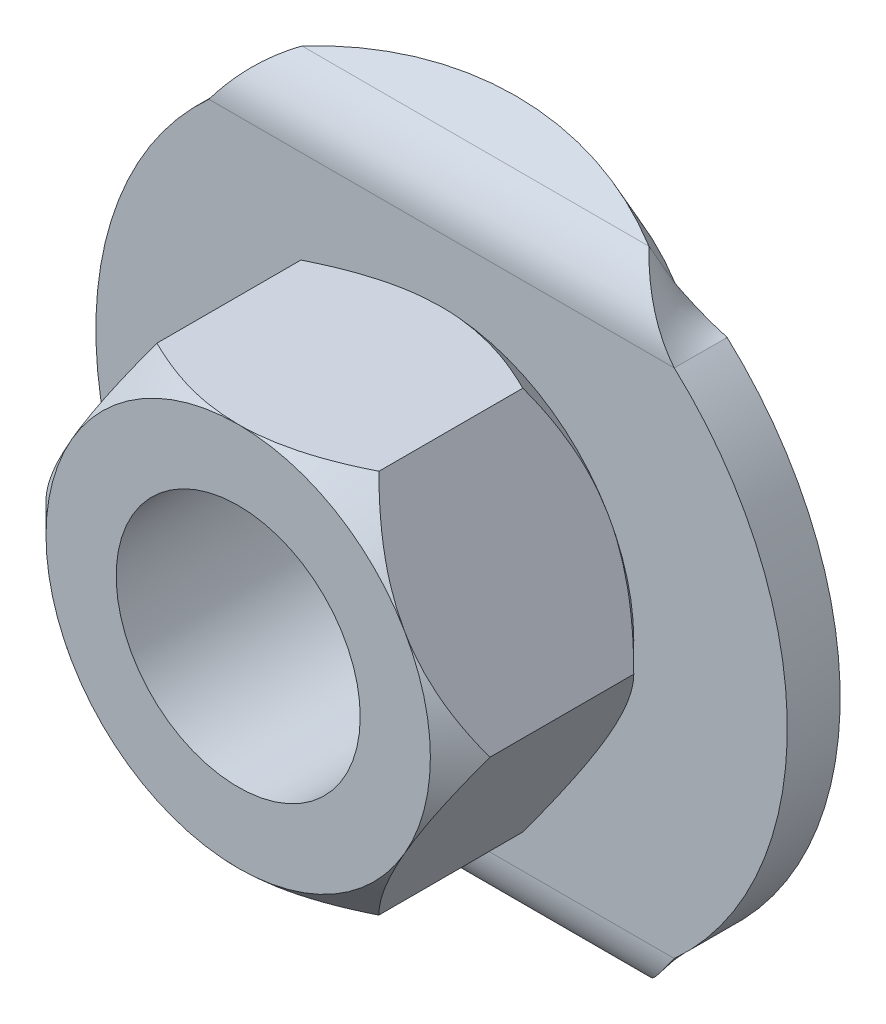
ISO-10303-21;
HEADER;
FILE_DESCRIPTION(('STEP AP214'),'2;1');
FILE_NAME('part.step','',(''),(''),'','','');
FILE_SCHEMA(('AUTOMOTIVE_DESIGN { 1 0 10303 214 1 1 1 1 }'));
ENDSEC;
DATA;
#1=APPLICATION_CONTEXT('core data for automotive mechanical design processes');
#2=APPLICATION_PROTOCOL_DEFINITION('international standard','automotive_design',2000,#1);
#3=PRODUCT_CONTEXT('',#1,'mechanical');
#4=PRODUCT('Part','Part','',(#3));
#5=PRODUCT_RELATED_PRODUCT_CATEGORY('part','',(#4));
#6=PRODUCT_DEFINITION_FORMATION('','',#4);
#7=PRODUCT_DEFINITION_CONTEXT('part definition',#1,'design');
#8=PRODUCT_DEFINITION('design','',#6,#7);
#9=PRODUCT_DEFINITION_SHAPE('','',#8);
#10=(LENGTH_UNIT() NAMED_UNIT(*) SI_UNIT(.MILLI.,.METRE.));
#11=(NAMED_UNIT(*) PLANE_ANGLE_UNIT() SI_UNIT($,.RADIAN.));
#12=(NAMED_UNIT(*) SI_UNIT($,.STERADIAN.) SOLID_ANGLE_UNIT());
#13=UNCERTAINTY_MEASURE_WITH_UNIT(LENGTH_MEASURE(1.E-05),#10,'distance_accuracy_value','');
#14=(GEOMETRIC_REPRESENTATION_CONTEXT(3) GLOBAL_UNCERTAINTY_ASSIGNED_CONTEXT((#13)) GLOBAL_UNIT_ASSIGNED_CONTEXT((#10,
#11,#12)) REPRESENTATION_CONTEXT('',''));
#15=CARTESIAN_POINT('',(0.,0.,0.));
#16=DIRECTION('',(0.,0.,1.));
#17=DIRECTION('',(1.,0.,0.));
#18=AXIS2_PLACEMENT_3D('',#15,#16,#17);
#19=CARTESIAN_POINT('',(0.,8.11002564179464,13.6677602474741));
#20=DIRECTION('',(0.,-0.86602540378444,-0.5));
#21=DIRECTION('',(1.,0.,0.));
#22=AXIS2_PLACEMENT_3D('',#19,#20,#21);
#23=PLANE('',#22);
#24=DIRECTION('',(-1.,0.,0.));
#25=VECTOR('',#24,1.);
#26=CARTESIAN_POINT('',(0.,15.463193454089,0.931699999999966));
#27=LINE('',#26,#25);
#28=CARTESIAN_POINT('',(8.5278187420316,15.463193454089,0.931699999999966));
#29=VERTEX_POINT('',#28);
#30=CARTESIAN_POINT('',(-8.5278187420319,15.463193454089,0.931699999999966));
#31=VERTEX_POINT('',#30);
#32=EDGE_CURVE('E1780',#29,#31,#27,.T.);
#33=ORIENTED_EDGE('',*,*,#32,.F.);
#34=CARTESIAN_POINT('',(0.,8.11002564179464,13.6677602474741));
#35=DIRECTION('',(0.,-0.86602540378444,-0.5));
#36=DIRECTION('',(1.,0.,0.));
#37=AXIS2_PLACEMENT_3D('',#34,#35,#36);
#38=CIRCLE('',#37,17.);
#39=EDGE_CURVE('E1779',#31,#29,#38,.T.);
#40=ORIENTED_EDGE('',*,*,#39,.F.);
#41=EDGE_LOOP('',(#33,#40));
#42=FACE_BOUND('',#41,.T.);
#43=ADVANCED_FACE('F14',(#42),#23,.F.);
#44=CARTESIAN_POINT('',(0.,5.8583595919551,12.3677602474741));
#45=DIRECTION('',(0.,0.86602540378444,0.5));
#46=DIRECTION('',(-1.,0.,0.));
#47=AXIS2_PLACEMENT_3D('',#44,#45,#46);
#48=CYLINDRICAL_SURFACE('',#47,17.);
#49=CARTESIAN_POINT('',(8.5278187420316,13.2115274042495,-0.368300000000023));
#50=CARTESIAN_POINT('',(8.5278187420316,15.463193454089,0.931699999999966));
#51=(BOUNDED_CURVE() B_SPLINE_CURVE(1,(#49,#50),.UNSPECIFIED.,.F.,
.F.) B_SPLINE_CURVE_WITH_KNOTS((2,2),(0.,1.),
.UNSPECIFIED.) CURVE() GEOMETRIC_REPRESENTATION_ITEM() RATIONAL_B_SPLINE_CURVE((1.,1.)) REPRESENTATION_ITEM(''));
#52=CARTESIAN_POINT('',(8.5278187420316,13.2115274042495,-0.368300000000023));
#53=VERTEX_POINT('',#52);
#54=EDGE_CURVE('E1687',#53,#29,#51,.T.);
#55=ORIENTED_EDGE('',*,*,#54,.F.);
#56=CARTESIAN_POINT('',(0.,5.8583595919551,12.3677602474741));
#57=DIRECTION('',(0.,-0.86602540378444,-0.5));
#58=DIRECTION('',(1.,0.,0.));
#59=AXIS2_PLACEMENT_3D('',#56,#57,#58);
#60=CIRCLE('',#59,17.);
#61=CARTESIAN_POINT('',(-8.5278187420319,13.2115274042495,-0.368300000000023));
#62=VERTEX_POINT('',#61);
#63=EDGE_CURVE('E1776',#62,#53,#60,.T.);
#64=ORIENTED_EDGE('',*,*,#63,.F.);
#65=CARTESIAN_POINT('',(-8.5278187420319,15.463193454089,0.931699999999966));
#66=CARTESIAN_POINT('',(-8.5278187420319,13.2115274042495,-0.368300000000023));
#67=(BOUNDED_CURVE() B_SPLINE_CURVE(1,(#65,#66),.UNSPECIFIED.,.F.,
.F.) B_SPLINE_CURVE_WITH_KNOTS((2,2),(0.,1.),
.UNSPECIFIED.) CURVE() GEOMETRIC_REPRESENTATION_ITEM() RATIONAL_B_SPLINE_CURVE((1.,1.)) REPRESENTATION_ITEM(''));
#68=EDGE_CURVE('E1789',#31,#62,#67,.T.);
#69=ORIENTED_EDGE('',*,*,#68,.F.);
#70=ORIENTED_EDGE('',*,*,#39,.T.);
#71=EDGE_LOOP('',(#55,#64,#69,#70));
#72=FACE_BOUND('',#71,.T.);
#73=ADVANCED_FACE('F1335',(#72),#48,.T.);
#74=CARTESIAN_POINT('',(0.,5.8583595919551,12.3677602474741));
#75=DIRECTION('',(0.,-0.86602540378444,-0.5));
#76=DIRECTION('',(1.,0.,0.));
#77=AXIS2_PLACEMENT_3D('',#74,#75,#76);
#78=PLANE('',#77);
#79=ORIENTED_EDGE('',*,*,#63,.T.);
#80=DIRECTION('',(-1.,0.,0.));
#81=VECTOR('',#80,1.);
#82=CARTESIAN_POINT('',(0.,13.2115274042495,-0.368300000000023));
#83=LINE('',#82,#81);
#84=EDGE_CURVE('E1783',#53,#62,#83,.T.);
#85=ORIENTED_EDGE('',*,*,#84,.T.);
#86=EDGE_LOOP('',(#79,#85));
#87=FACE_BOUND('',#86,.T.);
#88=ADVANCED_FACE('F1266',(#87),#78,.T.);
#89=CARTESIAN_POINT('',(-23.1284569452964,12.5736130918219,-0.736600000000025));
#90=DIRECTION('',(1.,0.,0.));
#91=DIRECTION('',(0.,0.,1.));
#92=AXIS2_PLACEMENT_3D('',#89,#90,#91);
#93=CYLINDRICAL_SURFACE('',#92,3.3366);
#94=DIRECTION('',(-1.,0.,0.));
#95=VECTOR('',#94,1.);
#96=CARTESIAN_POINT('',(0.,12.5736130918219,2.6));
#97=LINE('',#96,#95);
#98=CARTESIAN_POINT('',(11.441339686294,12.5736130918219,2.6));
#99=VERTEX_POINT('',#98);
#100=CARTESIAN_POINT('',(-11.4413396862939,12.5736130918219,2.6));
#101=VERTEX_POINT('',#100);
#102=EDGE_CURVE('E1575',#99,#101,#97,.T.);
#103=ORIENTED_EDGE('',*,*,#102,.F.);
#104=CARTESIAN_POINT('',(8.5278187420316,15.463193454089,0.931699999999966));
#105=CARTESIAN_POINT('',(9.01356765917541,15.1719229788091,1.43619526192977));
#106=CARTESIAN_POINT('',(9.4989923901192,14.7462400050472,1.86180708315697));
#107=CARTESIAN_POINT('',(10.4701660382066,13.7375861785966,2.44415364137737));
#108=CARTESIAN_POINT('',(10.9555907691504,13.156154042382,2.6));
#109=CARTESIAN_POINT('',(11.441339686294,12.5736130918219,2.6));
#110=(BOUNDED_CURVE() B_SPLINE_CURVE(3,(#104,#105,#106,#107,#108,#109),.UNSPECIFIED.,.F.,
.F.) B_SPLINE_CURVE_WITH_KNOTS((4,2,4),(0.,0.5,1.),
.UNSPECIFIED.) CURVE() GEOMETRIC_REPRESENTATION_ITEM() RATIONAL_B_SPLINE_CURVE((1.,1.,1.,1.,1.,1.)) REPRESENTATION_ITEM(''));
#111=EDGE_CURVE('E1856',#29,#99,#110,.T.);
#112=ORIENTED_EDGE('',*,*,#111,.F.);
#113=ORIENTED_EDGE('',*,*,#32,.T.);
#114=CARTESIAN_POINT('',(-11.4413396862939,12.5736130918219,2.6));
#115=CARTESIAN_POINT('',(-11.1605977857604,12.9496910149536,2.6));
#116=CARTESIAN_POINT('',(-10.8896914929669,13.3029484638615,2.53634768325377));
#117=CARTESIAN_POINT('',(-10.3663553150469,13.9363095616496,2.32724969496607));
#118=CARTESIAN_POINT('',(-10.1141245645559,14.2164029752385,2.18211938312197));
#119=CARTESIAN_POINT('',(-9.3857443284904,14.9374987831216,1.68911051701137));
#120=CARTESIAN_POINT('',(-8.93631927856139,15.2574576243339,1.28804491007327));
#121=CARTESIAN_POINT('',(-8.5278187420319,15.463193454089,0.931699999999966));
#122=(BOUNDED_CURVE() B_SPLINE_CURVE(3,(#114,#115,#116,#117,#118,#119,#120,#121),.UNSPECIFIED.,
.F.,.F.) B_SPLINE_CURVE_WITH_KNOTS((4,2,2,4),(0.,0.25,0.5,1.),
.UNSPECIFIED.) CURVE() GEOMETRIC_REPRESENTATION_ITEM() RATIONAL_B_SPLINE_CURVE((1.,1.,1.,1.,1.,
1.,1.,1.)) REPRESENTATION_ITEM(''));
#123=EDGE_CURVE('E1792',#101,#31,#122,.T.);
#124=ORIENTED_EDGE('',*,*,#123,.F.);
#125=EDGE_LOOP('',(#103,#112,#113,#124));
#126=FACE_BOUND('',#125,.T.);
#127=ADVANCED_FACE('F1260',(#126),#93,.T.);
#128=CARTESIAN_POINT('',(-23.1284569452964,12.5736130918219,-0.736600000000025));
#129=DIRECTION('',(1.,0.,0.));
#130=DIRECTION('',(0.,0.,1.));
#131=AXIS2_PLACEMENT_3D('',#128,#129,#130);
#132=CYLINDRICAL_SURFACE('',#131,0.7366);
#133=DIRECTION('',(-1.,0.,0.));
#134=VECTOR('',#133,1.);
#135=CARTESIAN_POINT('',(0.,12.5736130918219,0.));
#136=LINE('',#135,#134);
#137=CARTESIAN_POINT('',(11.441339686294,12.5736130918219,0.));
#138=VERTEX_POINT('',#137);
#139=CARTESIAN_POINT('',(-11.4413396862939,12.5736130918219,0.));
#140=VERTEX_POINT('',#139);
#141=EDGE_CURVE('E1735',#138,#140,#136,.T.);
#142=ORIENTED_EDGE('',*,*,#141,.T.);
#143=CARTESIAN_POINT('',(-8.5278187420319,13.2115274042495,-0.368300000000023));
#144=CARTESIAN_POINT('',(-8.93775832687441,13.1659484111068,-0.289354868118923));
#145=CARTESIAN_POINT('',(-9.3857443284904,13.0954731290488,-0.201091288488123));
#146=CARTESIAN_POINT('',(-10.1141245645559,12.9362813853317,-0.0922528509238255));
#147=CARTESIAN_POINT('',(-10.3663553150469,12.8744469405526,-0.0602133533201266));
#148=CARTESIAN_POINT('',(-10.8896914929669,12.73462383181,-0.0140521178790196));
#149=CARTESIAN_POINT('',(-11.1607719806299,12.6565859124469,0.));
#150=CARTESIAN_POINT('',(-11.4413396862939,12.5736130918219,0.));
#151=(BOUNDED_CURVE() B_SPLINE_CURVE(3,(#143,#144,#145,#146,#147,#148,#149,#150),.UNSPECIFIED.,
.F.,.F.) B_SPLINE_CURVE_WITH_KNOTS((4,2,2,4),(0.,0.5,0.75,1.),
.UNSPECIFIED.) CURVE() GEOMETRIC_REPRESENTATION_ITEM() RATIONAL_B_SPLINE_CURVE((1.,1.,1.,1.,1.,
1.,1.,1.)) REPRESENTATION_ITEM(''));
#152=EDGE_CURVE('E132',#140,#62,#151,.F.);
#153=ORIENTED_EDGE('',*,*,#152,.T.);
#154=ORIENTED_EDGE('',*,*,#84,.F.);
#155=CARTESIAN_POINT('',(11.441339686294,12.5736130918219,0.));
#156=CARTESIAN_POINT('',(10.955734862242,12.7021788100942,0.));
#157=CARTESIAN_POINT('',(10.4701660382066,12.8305760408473,-0.0344052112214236));
#158=CARTESIAN_POINT('',(9.4989923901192,13.0532501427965,-0.16296616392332));
#159=CARTESIAN_POINT('',(9.01342356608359,13.1472445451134,-0.256958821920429));
#160=CARTESIAN_POINT('',(8.5278187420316,13.2115274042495,-0.368300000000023));
#161=(BOUNDED_CURVE() B_SPLINE_CURVE(3,(#155,#156,#157,#158,#159,#160),.UNSPECIFIED.,.F.,
.F.) B_SPLINE_CURVE_WITH_KNOTS((4,2,4),(0.,0.5,1.),
.UNSPECIFIED.) CURVE() GEOMETRIC_REPRESENTATION_ITEM() RATIONAL_B_SPLINE_CURVE((1.,1.,1.,1.,1.,1.)) REPRESENTATION_ITEM(''));
#162=EDGE_CURVE('E1861',#53,#138,#161,.F.);
#163=ORIENTED_EDGE('',*,*,#162,.T.);
#164=EDGE_LOOP('',(#142,#153,#154,#163));
#165=FACE_BOUND('',#164,.T.);
#166=ADVANCED_FACE('F1265',(#165),#132,.F.);
#167=CARTESIAN_POINT('',(-11.4413396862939,12.5736130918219,2.6));
#168=CARTESIAN_POINT('',(-11.1605977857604,12.9496910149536,2.6));
#169=CARTESIAN_POINT('',(-10.8896914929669,13.3029484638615,2.53634768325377));
#170=CARTESIAN_POINT('',(-10.3663553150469,13.9363095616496,2.32724969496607));
#171=CARTESIAN_POINT('',(-10.1141245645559,14.2164029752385,2.18211938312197));
#172=CARTESIAN_POINT('',(-9.3857443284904,14.9374987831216,1.68911051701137));
#173=CARTESIAN_POINT('',(-8.93631927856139,15.2574576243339,1.28804491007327));
#174=CARTESIAN_POINT('',(-8.5278187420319,15.463193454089,0.931699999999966));
#175=CARTESIAN_POINT('',(-11.4413396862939,12.5736130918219,0.));
#176=CARTESIAN_POINT('',(-11.1607719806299,12.6565859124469,0.));
#177=CARTESIAN_POINT('',(-10.8896914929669,12.73462383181,-0.0140521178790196));
#178=CARTESIAN_POINT('',(-10.3663553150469,12.8744469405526,-0.0602133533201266));
#179=CARTESIAN_POINT('',(-10.1141245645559,12.9362813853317,-0.0922528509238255));
#180=CARTESIAN_POINT('',(-9.3857443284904,13.0954731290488,-0.201091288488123));
#181=CARTESIAN_POINT('',(-8.93775832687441,13.1659484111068,-0.289354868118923));
#182=CARTESIAN_POINT('',(-8.5278187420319,13.2115274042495,-0.368300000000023));
#183=(BOUNDED_SURFACE() B_SPLINE_SURFACE(1,3,((#167,#168,#169,#170,#171,#172,#173,#174),(#175,
#176,#177,#178,#179,#180,#181,#182)),.UNSPECIFIED.,.F.,.F.,.F.) B_SPLINE_SURFACE_WITH_KNOTS((2,
2),(4,2,2,4),(0.,1.),(0.,0.25,0.5,1.),
.UNSPECIFIED.) GEOMETRIC_REPRESENTATION_ITEM() RATIONAL_B_SPLINE_SURFACE(((1.,1.,1.,1.,1.,1.,1.,
1.),(1.,1.,1.,1.,1.,1.,1.,1.))) REPRESENTATION_ITEM('') SURFACE());
#184=CARTESIAN_POINT('',(-11.4413396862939,12.5736130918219,2.6));
#185=CARTESIAN_POINT('',(-11.4413396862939,12.5736130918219,1.73333333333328));
#186=CARTESIAN_POINT('',(-11.4413396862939,12.5736130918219,0.866666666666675));
#187=CARTESIAN_POINT('',(-11.4413396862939,12.5736130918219,0.));
#188=(BOUNDED_CURVE() B_SPLINE_CURVE(3,(#184,#185,#186,#187),.UNSPECIFIED.,.F.,
.F.) B_SPLINE_CURVE_WITH_KNOTS((4,4),(0.,1.),
.UNSPECIFIED.) CURVE() GEOMETRIC_REPRESENTATION_ITEM() RATIONAL_B_SPLINE_CURVE((1.,1.,1.,1.)) REPRESENTATION_ITEM(''));
#189=EDGE_CURVE('E1581',#101,#140,#188,.T.);
#190=ORIENTED_EDGE('',*,*,#123,.T.);
#191=ORIENTED_EDGE('',*,*,#68,.T.);
#192=ORIENTED_EDGE('',*,*,#152,.F.);
#193=ORIENTED_EDGE('',*,*,#189,.F.);
#194=EDGE_LOOP('',(#190,#191,#192,#193));
#195=FACE_BOUND('',#194,.T.);
#196=ADVANCED_FACE('F1314',(#195),#183,.F.);
#197=CARTESIAN_POINT('',(8.5278187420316,15.463193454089,0.931699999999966));
#198=CARTESIAN_POINT('',(9.01356765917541,15.1719229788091,1.43619526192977));
#199=CARTESIAN_POINT('',(9.4989923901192,14.7462400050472,1.86180708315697));
#200=CARTESIAN_POINT('',(10.4701660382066,13.7375861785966,2.44415364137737));
#201=CARTESIAN_POINT('',(10.9555907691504,13.156154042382,2.6));
#202=CARTESIAN_POINT('',(11.441339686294,12.5736130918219,2.6));
#203=CARTESIAN_POINT('',(8.5278187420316,13.2115274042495,-0.368300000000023));
#204=CARTESIAN_POINT('',(9.01342356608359,13.1472445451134,-0.256958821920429));
#205=CARTESIAN_POINT('',(9.4989923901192,13.0532501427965,-0.16296616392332));
#206=CARTESIAN_POINT('',(10.4701660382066,12.8305760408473,-0.0344052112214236));
#207=CARTESIAN_POINT('',(10.955734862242,12.7021788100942,0.));
#208=CARTESIAN_POINT('',(11.441339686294,12.5736130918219,0.));
#209=(BOUNDED_SURFACE() B_SPLINE_SURFACE(1,3,((#197,#198,#199,#200,#201,#202),(#203,#204,#205,
#206,#207,#208)),.UNSPECIFIED.,.F.,.F.,.F.) B_SPLINE_SURFACE_WITH_KNOTS((2,2),(4,2,4),(0.,1.),
(0.,0.5,1.),.UNSPECIFIED.) GEOMETRIC_REPRESENTATION_ITEM() RATIONAL_B_SPLINE_SURFACE(((1.,1.,1.,
1.,1.,1.),(1.,1.,1.,1.,1.,1.))) REPRESENTATION_ITEM('') SURFACE());
#210=CARTESIAN_POINT('',(11.441339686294,12.5736130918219,0.));
#211=CARTESIAN_POINT('',(11.441339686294,12.5736130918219,0.866666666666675));
#212=CARTESIAN_POINT('',(11.441339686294,12.5736130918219,1.73333333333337));
#213=CARTESIAN_POINT('',(11.441339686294,12.5736130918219,2.6));
#214=(BOUNDED_CURVE() B_SPLINE_CURVE(3,(#210,#211,#212,#213),.UNSPECIFIED.,.F.,
.F.) B_SPLINE_CURVE_WITH_KNOTS((4,4),(0.,1.),
.UNSPECIFIED.) CURVE() GEOMETRIC_REPRESENTATION_ITEM() RATIONAL_B_SPLINE_CURVE((1.,1.,1.,1.)) REPRESENTATION_ITEM(''));
#215=EDGE_CURVE('E1565',#138,#99,#214,.T.);
#216=ORIENTED_EDGE('',*,*,#54,.T.);
#217=ORIENTED_EDGE('',*,*,#111,.T.);
#218=ORIENTED_EDGE('',*,*,#215,.F.);
#219=ORIENTED_EDGE('',*,*,#162,.F.);
#220=EDGE_LOOP('',(#216,#217,#218,#219));
#221=FACE_BOUND('',#220,.T.);
#222=ADVANCED_FACE('F1325',(#221),#209,.F.);
#223=CARTESIAN_POINT('',(0.,-8.11002564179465,13.6677602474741));
#224=DIRECTION('',(0.,0.86602540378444,-0.5));
#225=DIRECTION('',(-1.,0.,0.));
#226=AXIS2_PLACEMENT_3D('',#223,#224,#225);
#227=PLANE('',#226);
#228=DIRECTION('',(1.,0.,0.));
#229=VECTOR('',#228,1.);
#230=CARTESIAN_POINT('',(0.,-15.463193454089,0.931700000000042));
#231=LINE('',#230,#229);
#232=CARTESIAN_POINT('',(-8.5278187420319,-15.463193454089,0.931700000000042));
#233=VERTEX_POINT('',#232);
#234=CARTESIAN_POINT('',(8.5278187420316,-15.463193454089,0.931700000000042));
#235=VERTEX_POINT('',#234);
#236=EDGE_CURVE('E1545',#233,#235,#231,.T.);
#237=ORIENTED_EDGE('',*,*,#236,.F.);
#238=CARTESIAN_POINT('',(0.,-8.11002564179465,13.6677602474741));
#239=DIRECTION('',(0.,0.86602540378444,-0.5));
#240=DIRECTION('',(1.,0.,0.));
#241=AXIS2_PLACEMENT_3D('',#238,#239,#240);
#242=CIRCLE('',#241,17.);
#243=EDGE_CURVE('E1684',#235,#233,#242,.T.);
#244=ORIENTED_EDGE('',*,*,#243,.F.);
#245=EDGE_LOOP('',(#237,#244));
#246=FACE_BOUND('',#245,.T.);
#247=ADVANCED_FACE('F486',(#246),#227,.F.);
#248=CARTESIAN_POINT('',(0.,-5.8583595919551,12.3677602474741));
#249=DIRECTION('',(0.,-0.86602540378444,0.5));
#250=DIRECTION('',(-1.,0.,0.));
#251=AXIS2_PLACEMENT_3D('',#248,#249,#250);
#252=CYLINDRICAL_SURFACE('',#251,17.);
#253=CARTESIAN_POINT('',(-8.5278187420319,-13.2115274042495,-0.36829999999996));
#254=CARTESIAN_POINT('',(-8.5278187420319,-15.463193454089,0.931700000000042));
#255=(BOUNDED_CURVE() B_SPLINE_CURVE(1,(#253,#254),.UNSPECIFIED.,.F.,
.F.) B_SPLINE_CURVE_WITH_KNOTS((2,2),(0.,1.),
.UNSPECIFIED.) CURVE() GEOMETRIC_REPRESENTATION_ITEM() RATIONAL_B_SPLINE_CURVE((1.,1.)) REPRESENTATION_ITEM(''));
#256=CARTESIAN_POINT('',(-8.5278187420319,-13.2115274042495,-0.36829999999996));
#257=VERTEX_POINT('',#256);
#258=EDGE_CURVE('E1631',#257,#233,#255,.T.);
#259=ORIENTED_EDGE('',*,*,#258,.F.);
#260=CARTESIAN_POINT('',(0.,-5.8583595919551,12.3677602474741));
#261=DIRECTION('',(0.,0.86602540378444,-0.5));
#262=DIRECTION('',(1.,0.,0.));
#263=AXIS2_PLACEMENT_3D('',#260,#261,#262);
#264=CIRCLE('',#263,17.);
#265=CARTESIAN_POINT('',(8.5278187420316,-13.2115274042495,-0.36829999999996));
#266=VERTEX_POINT('',#265);
#267=EDGE_CURVE('E1688',#266,#257,#264,.T.);
#268=ORIENTED_EDGE('',*,*,#267,.F.);
#269=CARTESIAN_POINT('',(8.5278187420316,-15.463193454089,0.931700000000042));
#270=CARTESIAN_POINT('',(8.5278187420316,-13.2115274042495,-0.36829999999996));
#271=(BOUNDED_CURVE() B_SPLINE_CURVE(1,(#269,#270),.UNSPECIFIED.,.F.,
.F.) B_SPLINE_CURVE_WITH_KNOTS((2,2),(0.,1.),
.UNSPECIFIED.) CURVE() GEOMETRIC_REPRESENTATION_ITEM() RATIONAL_B_SPLINE_CURVE((1.,1.)) REPRESENTATION_ITEM(''));
#272=EDGE_CURVE('E1550',#235,#266,#271,.T.);
#273=ORIENTED_EDGE('',*,*,#272,.F.);
#274=ORIENTED_EDGE('',*,*,#243,.T.);
#275=EDGE_LOOP('',(#259,#268,#273,#274));
#276=FACE_BOUND('',#275,.T.);
#277=ADVANCED_FACE('F1391',(#276),#252,.T.);
#278=CARTESIAN_POINT('',(0.,-5.8583595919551,12.3677602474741));
#279=DIRECTION('',(0.,0.86602540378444,-0.5));
#280=DIRECTION('',(-1.,0.,0.));
#281=AXIS2_PLACEMENT_3D('',#278,#279,#280);
#282=PLANE('',#281);
#283=ORIENTED_EDGE('',*,*,#267,.T.);
#284=DIRECTION('',(1.,0.,0.));
#285=VECTOR('',#284,1.);
#286=CARTESIAN_POINT('',(0.,-13.2115274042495,-0.36829999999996));
#287=LINE('',#286,#285);
#288=EDGE_CURVE('E1692',#257,#266,#287,.T.);
#289=ORIENTED_EDGE('',*,*,#288,.T.);
#290=EDGE_LOOP('',(#283,#289));
#291=FACE_BOUND('',#290,.T.);
#292=ADVANCED_FACE('F1303',(#291),#282,.T.);
#293=CARTESIAN_POINT('',(23.1284569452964,-12.5736130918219,-0.736599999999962));
#294=DIRECTION('',(-1.,0.,0.));
#295=DIRECTION('',(0.,1.,0.));
#296=AXIS2_PLACEMENT_3D('',#293,#294,#295);
#297=CYLINDRICAL_SURFACE('',#296,3.3366);
#298=DIRECTION('',(1.,0.,0.));
#299=VECTOR('',#298,1.);
#300=CARTESIAN_POINT('',(0.,-12.5736130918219,2.60000000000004));
#301=LINE('',#300,#299);
#302=CARTESIAN_POINT('',(-11.4413396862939,-12.5736130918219,2.60000000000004));
#303=VERTEX_POINT('',#302);
#304=CARTESIAN_POINT('',(11.441339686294,-12.5736130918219,2.60000000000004));
#305=VERTEX_POINT('',#304);
#306=EDGE_CURVE('E1543',#303,#305,#301,.T.);
#307=ORIENTED_EDGE('',*,*,#306,.F.);
#308=CARTESIAN_POINT('',(-8.5278187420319,-15.463193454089,0.931700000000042));
#309=CARTESIAN_POINT('',(-9.01356765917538,-15.171922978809,1.43619526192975));
#310=CARTESIAN_POINT('',(-9.49899239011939,-14.7462400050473,1.86180708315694));
#311=CARTESIAN_POINT('',(-10.4701660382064,-13.7375861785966,2.44415364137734));
#312=CARTESIAN_POINT('',(-10.9555907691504,-13.156154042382,2.60000000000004));
#313=CARTESIAN_POINT('',(-11.4413396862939,-12.5736130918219,2.60000000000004));
#314=(BOUNDED_CURVE() B_SPLINE_CURVE(3,(#308,#309,#310,#311,#312,#313),.UNSPECIFIED.,.F.,
.F.) B_SPLINE_CURVE_WITH_KNOTS((4,2,4),(0.,0.5,1.),
.UNSPECIFIED.) CURVE() GEOMETRIC_REPRESENTATION_ITEM() RATIONAL_B_SPLINE_CURVE((1.,1.,1.,1.,1.,1.)) REPRESENTATION_ITEM(''));
#315=EDGE_CURVE('E1662',#233,#303,#314,.T.);
#316=ORIENTED_EDGE('',*,*,#315,.F.);
#317=ORIENTED_EDGE('',*,*,#236,.T.);
#318=CARTESIAN_POINT('',(11.441339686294,-12.5736130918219,2.60000000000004));
#319=CARTESIAN_POINT('',(11.1606329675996,-12.9496555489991,2.60000000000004));
#320=CARTESIAN_POINT('',(10.8897528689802,-13.3028872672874,2.53635951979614));
#321=CARTESIAN_POINT('',(10.3664517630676,-13.9362197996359,2.32728769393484));
#322=CARTESIAN_POINT('',(10.1142297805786,-14.2163102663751,2.18217156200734));
#323=CARTESIAN_POINT('',(9.38584954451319,-14.9374217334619,1.68918560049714));
#324=CARTESIAN_POINT('',(8.93638996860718,-15.2574220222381,1.28810657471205));
#325=CARTESIAN_POINT('',(8.5278187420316,-15.463193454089,0.931700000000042));
#326=(BOUNDED_CURVE() B_SPLINE_CURVE(3,(#318,#319,#320,#321,#322,#323,#324,#325),.UNSPECIFIED.,
.F.,.F.) B_SPLINE_CURVE_WITH_KNOTS((4,2,2,4),(0.,0.25,0.5,1.),
.UNSPECIFIED.) CURVE() GEOMETRIC_REPRESENTATION_ITEM() RATIONAL_B_SPLINE_CURVE((1.,1.,1.,1.,1.,
1.,1.,1.)) REPRESENTATION_ITEM(''));
#327=EDGE_CURVE('E1538',#305,#235,#326,.T.);
#328=ORIENTED_EDGE('',*,*,#327,.F.);
#329=EDGE_LOOP('',(#307,#316,#317,#328));
#330=FACE_BOUND('',#329,.T.);
#331=ADVANCED_FACE('F1283',(#330),#297,.T.);
#332=CARTESIAN_POINT('',(23.1284569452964,-12.5736130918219,-0.736599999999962));
#333=DIRECTION('',(-1.,0.,0.));
#334=DIRECTION('',(0.,1.,0.));
#335=AXIS2_PLACEMENT_3D('',#332,#333,#334);
#336=CYLINDRICAL_SURFACE('',#335,0.7366);
#337=DIRECTION('',(1.,0.,0.));
#338=VECTOR('',#337,1.);
#339=CARTESIAN_POINT('',(0.,-12.5736130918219,0.));
#340=LINE('',#339,#338);
#341=CARTESIAN_POINT('',(-11.4413396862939,-12.5736130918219,0.));
#342=VERTEX_POINT('',#341);
#343=CARTESIAN_POINT('',(11.441339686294,-12.5736130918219,0.));
#344=VERTEX_POINT('',#343);
#345=EDGE_CURVE('E1730',#342,#344,#340,.T.);
#346=ORIENTED_EDGE('',*,*,#345,.T.);
#347=CARTESIAN_POINT('',(8.5278187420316,-13.2115274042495,-0.36829999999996));
#348=CARTESIAN_POINT('',(8.93782852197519,-13.1659406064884,-0.289341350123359));
#349=CARTESIAN_POINT('',(9.38584954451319,-13.0954561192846,-0.201074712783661));
#350=CARTESIAN_POINT('',(10.1142297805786,-12.9362609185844,-0.092241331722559));
#351=CARTESIAN_POINT('',(10.3664517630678,-12.8744271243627,-0.060204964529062));
#352=CARTESIAN_POINT('',(10.8897528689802,-12.7346103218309,-0.0140495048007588));
#353=CARTESIAN_POINT('',(11.1608070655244,-12.656578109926,0.));
#354=CARTESIAN_POINT('',(11.441339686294,-12.5736130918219,0.));
#355=(BOUNDED_CURVE() B_SPLINE_CURVE(3,(#347,#348,#349,#350,#351,#352,#353,#354),.UNSPECIFIED.,
.F.,.F.) B_SPLINE_CURVE_WITH_KNOTS((4,2,2,4),(0.,0.5,0.75,1.),
.UNSPECIFIED.) CURVE() GEOMETRIC_REPRESENTATION_ITEM() RATIONAL_B_SPLINE_CURVE((1.,1.,1.,1.,1.,
1.,1.,1.)) REPRESENTATION_ITEM(''));
#356=EDGE_CURVE('E1557',#344,#266,#355,.F.);
#357=ORIENTED_EDGE('',*,*,#356,.T.);
#358=ORIENTED_EDGE('',*,*,#288,.F.);
#359=CARTESIAN_POINT('',(-11.4413396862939,-12.5736130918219,0.));
#360=CARTESIAN_POINT('',(-10.9557348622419,-12.7021788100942,0.));
#361=CARTESIAN_POINT('',(-10.4701660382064,-12.8305760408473,-0.0344052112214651));
#362=CARTESIAN_POINT('',(-9.49899239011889,-13.0532501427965,-0.162966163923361));
#363=CARTESIAN_POINT('',(-9.0134235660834,-13.1472445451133,-0.256958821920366));
#364=CARTESIAN_POINT('',(-8.5278187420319,-13.2115274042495,-0.36829999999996));
#365=(BOUNDED_CURVE() B_SPLINE_CURVE(3,(#359,#360,#361,#362,#363,#364),.UNSPECIFIED.,.F.,
.F.) B_SPLINE_CURVE_WITH_KNOTS((4,2,4),(0.,0.5,1.),
.UNSPECIFIED.) CURVE() GEOMETRIC_REPRESENTATION_ITEM() RATIONAL_B_SPLINE_CURVE((1.,1.,1.,1.,1.,1.)) REPRESENTATION_ITEM(''));
#366=EDGE_CURVE('E1551',#257,#342,#365,.F.);
#367=ORIENTED_EDGE('',*,*,#366,.T.);
#368=EDGE_LOOP('',(#346,#357,#358,#367));
#369=FACE_BOUND('',#368,.T.);
#370=ADVANCED_FACE('F1277',(#369),#336,.F.);
#371=CARTESIAN_POINT('',(11.441339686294,-12.5736130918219,2.60000000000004));
#372=CARTESIAN_POINT('',(11.1606329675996,-12.9496555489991,2.60000000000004));
#373=CARTESIAN_POINT('',(10.8897528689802,-13.3028872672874,2.53635951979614));
#374=CARTESIAN_POINT('',(10.3664517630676,-13.9362197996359,2.32728769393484));
#375=CARTESIAN_POINT('',(10.1142297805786,-14.2163102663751,2.18217156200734));
#376=CARTESIAN_POINT('',(9.38584954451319,-14.9374217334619,1.68918560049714));
#377=CARTESIAN_POINT('',(8.93638996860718,-15.2574220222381,1.28810657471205));
#378=CARTESIAN_POINT('',(8.5278187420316,-15.463193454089,0.931700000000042));
#379=CARTESIAN_POINT('',(11.441339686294,-12.5736130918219,0.));
#380=CARTESIAN_POINT('',(11.1608070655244,-12.656578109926,0.));
#381=CARTESIAN_POINT('',(10.8897528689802,-12.7346103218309,-0.0140495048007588));
#382=CARTESIAN_POINT('',(10.3664517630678,-12.8744271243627,-0.060204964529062));
#383=CARTESIAN_POINT('',(10.1142297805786,-12.9362609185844,-0.092241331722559));
#384=CARTESIAN_POINT('',(9.38584954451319,-13.0954561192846,-0.201074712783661));
#385=CARTESIAN_POINT('',(8.93782852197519,-13.1659406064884,-0.289341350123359));
#386=CARTESIAN_POINT('',(8.5278187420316,-13.2115274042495,-0.36829999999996));
#387=(BOUNDED_SURFACE() B_SPLINE_SURFACE(1,3,((#371,#372,#373,#374,#375,#376,#377,#378),(#379,
#380,#381,#382,#383,#384,#385,#386)),.UNSPECIFIED.,.F.,.F.,.F.) B_SPLINE_SURFACE_WITH_KNOTS((2,
2),(4,2,2,4),(0.,1.),(0.,0.25,0.5,1.),
.UNSPECIFIED.) GEOMETRIC_REPRESENTATION_ITEM() RATIONAL_B_SPLINE_SURFACE(((1.,1.,1.,1.,1.,1.,1.,
1.),(1.,1.,1.,1.,1.,1.,1.,1.))) REPRESENTATION_ITEM('') SURFACE());
#388=CARTESIAN_POINT('',(11.441339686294,-12.5736130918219,2.60000000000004));
#389=CARTESIAN_POINT('',(11.441339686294,-12.5736130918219,1.73333333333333));
#390=CARTESIAN_POINT('',(11.441339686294,-12.5736130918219,0.866666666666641));
#391=CARTESIAN_POINT('',(11.441339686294,-12.5736130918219,0.));
#392=(BOUNDED_CURVE() B_SPLINE_CURVE(3,(#388,#389,#390,#391),.UNSPECIFIED.,.F.,
.F.) B_SPLINE_CURVE_WITH_KNOTS((4,4),(0.,1.),
.UNSPECIFIED.) CURVE() GEOMETRIC_REPRESENTATION_ITEM() RATIONAL_B_SPLINE_CURVE((1.,1.,1.,1.)) REPRESENTATION_ITEM(''));
#393=EDGE_CURVE('E1555',#305,#344,#392,.T.);
#394=ORIENTED_EDGE('',*,*,#327,.T.);
#395=ORIENTED_EDGE('',*,*,#272,.T.);
#396=ORIENTED_EDGE('',*,*,#356,.F.);
#397=ORIENTED_EDGE('',*,*,#393,.F.);
#398=EDGE_LOOP('',(#394,#395,#396,#397));
#399=FACE_BOUND('',#398,.T.);
#400=ADVANCED_FACE('F1282',(#399),#387,.F.);
#401=CARTESIAN_POINT('',(-8.5278187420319,-15.463193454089,0.931700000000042));
#402=CARTESIAN_POINT('',(-9.01356765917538,-15.171922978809,1.43619526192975));
#403=CARTESIAN_POINT('',(-9.49899239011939,-14.7462400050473,1.86180708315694));
#404=CARTESIAN_POINT('',(-10.4701660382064,-13.7375861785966,2.44415364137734));
#405=CARTESIAN_POINT('',(-10.9555907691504,-13.156154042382,2.60000000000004));
#406=CARTESIAN_POINT('',(-11.4413396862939,-12.5736130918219,2.60000000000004));
#407=CARTESIAN_POINT('',(-8.5278187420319,-13.2115274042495,-0.36829999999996));
#408=CARTESIAN_POINT('',(-9.0134235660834,-13.1472445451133,-0.256958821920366));
#409=CARTESIAN_POINT('',(-9.49899239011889,-13.0532501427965,-0.162966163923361));
#410=CARTESIAN_POINT('',(-10.4701660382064,-12.8305760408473,-0.0344052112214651));
#411=CARTESIAN_POINT('',(-10.9557348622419,-12.7021788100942,0.));
#412=CARTESIAN_POINT('',(-11.4413396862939,-12.5736130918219,0.));
#413=(BOUNDED_SURFACE() B_SPLINE_SURFACE(1,3,((#401,#402,#403,#404,#405,#406),(#407,#408,#409,
#410,#411,#412)),.UNSPECIFIED.,.F.,.F.,.F.) B_SPLINE_SURFACE_WITH_KNOTS((2,2),(4,2,4),(0.,1.),
(0.,0.5,1.),.UNSPECIFIED.) GEOMETRIC_REPRESENTATION_ITEM() RATIONAL_B_SPLINE_SURFACE(((1.,1.,1.,
1.,1.,1.),(1.,1.,1.,1.,1.,1.))) REPRESENTATION_ITEM('') SURFACE());
#414=CARTESIAN_POINT('',(-11.4413396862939,-12.5736130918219,0.));
#415=CARTESIAN_POINT('',(-11.4413396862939,-12.5736130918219,0.866666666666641));
#416=CARTESIAN_POINT('',(-11.4413396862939,-12.5736130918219,1.73333333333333));
#417=CARTESIAN_POINT('',(-11.4413396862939,-12.5736130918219,2.60000000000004));
#418=(BOUNDED_CURVE() B_SPLINE_CURVE(3,(#414,#415,#416,#417),.UNSPECIFIED.,.F.,
.F.) B_SPLINE_CURVE_WITH_KNOTS((4,4),(0.,1.),
.UNSPECIFIED.) CURVE() GEOMETRIC_REPRESENTATION_ITEM() RATIONAL_B_SPLINE_CURVE((1.,1.,1.,1.)) REPRESENTATION_ITEM(''));
#419=EDGE_CURVE('E1564',#342,#303,#418,.T.);
#420=ORIENTED_EDGE('',*,*,#258,.T.);
#421=ORIENTED_EDGE('',*,*,#315,.T.);
#422=ORIENTED_EDGE('',*,*,#419,.F.);
#423=ORIENTED_EDGE('',*,*,#366,.F.);
#424=EDGE_LOOP('',(#420,#421,#422,#423));
#425=FACE_BOUND('',#424,.T.);
#426=ADVANCED_FACE('F1251',(#425),#413,.F.);
#427=CARTESIAN_POINT('',(0.,0.,0.));
#428=DIRECTION('',(0.,0.,-1.));
#429=DIRECTION('',(1.,0.,0.));
#430=AXIS2_PLACEMENT_3D('',#427,#428,#429);
#431=PLANE('',#430);
#432=CARTESIAN_POINT('',(0.,0.,0.));
#433=DIRECTION('',(0.,0.,-1.));
#434=DIRECTION('',(1.,0.,0.));
#435=AXIS2_PLACEMENT_3D('',#432,#433,#434);
#436=CIRCLE('',#435,6.);
#437=CARTESIAN_POINT('',(6.,0.,0.));
#438=VERTEX_POINT('',#437);
#439=EDGE_CURVE('E622',#438,#438,#436,.T.);
#440=ORIENTED_EDGE('',*,*,#439,.F.);
#441=EDGE_LOOP('',(#440));
#442=FACE_BOUND('',#441,.T.);
#443=ORIENTED_EDGE('',*,*,#141,.F.);
#444=CARTESIAN_POINT('',(0.,0.,0.));
#445=DIRECTION('',(0.,0.,-1.));
#446=DIRECTION('',(1.,0.,0.));
#447=AXIS2_PLACEMENT_3D('',#444,#445,#446);
#448=CIRCLE('',#447,17.);
#449=EDGE_CURVE('E1574',#138,#344,#448,.T.);
#450=ORIENTED_EDGE('',*,*,#449,.T.);
#451=ORIENTED_EDGE('',*,*,#345,.F.);
#452=CARTESIAN_POINT('',(0.,0.,0.));
#453=DIRECTION('',(0.,0.,-1.));
#454=DIRECTION('',(1.,0.,0.));
#455=AXIS2_PLACEMENT_3D('',#452,#453,#454);
#456=CIRCLE('',#455,17.);
#457=EDGE_CURVE('E629',#342,#140,#456,.T.);
#458=ORIENTED_EDGE('',*,*,#457,.T.);
#459=EDGE_LOOP('',(#443,#450,#451,#458));
#460=FACE_BOUND('',#459,.T.);
#461=ADVANCED_FACE('F1240',(#442,#460),#431,.T.);
#462=CARTESIAN_POINT('',(0.,0.,0.));
#463=DIRECTION('',(0.,0.,1.));
#464=DIRECTION('',(-1.,0.,0.));
#465=AXIS2_PLACEMENT_3D('',#462,#463,#464);
#466=CYLINDRICAL_SURFACE('',#465,17.);
#467=ORIENTED_EDGE('',*,*,#449,.F.);
#468=ORIENTED_EDGE('',*,*,#215,.T.);
#469=CARTESIAN_POINT('',(0.,0.,2.6));
#470=DIRECTION('',(0.,0.,-1.));
#471=DIRECTION('',(1.,0.,0.));
#472=AXIS2_PLACEMENT_3D('',#469,#470,#471);
#473=CIRCLE('',#472,17.);
#474=EDGE_CURVE('E1569',#99,#305,#473,.T.);
#475=ORIENTED_EDGE('',*,*,#474,.T.);
#476=ORIENTED_EDGE('',*,*,#393,.T.);
#477=EDGE_LOOP('',(#467,#468,#475,#476));
#478=FACE_BOUND('',#477,.T.);
#479=ADVANCED_FACE('F1235',(#478),#466,.T.);
#480=CARTESIAN_POINT('',(0.,0.,2.6));
#481=DIRECTION('',(0.,0.,-1.));
#482=DIRECTION('',(1.,0.,0.));
#483=AXIS2_PLACEMENT_3D('',#480,#481,#482);
#484=PLANE('',#483);
#485=CARTESIAN_POINT('',(0.,0.,2.6));
#486=DIRECTION('',(0.,0.,-1.));
#487=DIRECTION('',(0.,1.,0.));
#488=AXIS2_PLACEMENT_3D('',#485,#486,#487);
#489=CIRCLE('',#488,9.45);
#490=CARTESIAN_POINT('',(-8.1839400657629,-4.725,2.6));
#491=VERTEX_POINT('',#490);
#492=CARTESIAN_POINT('',(-8.1839400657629,4.725,2.6));
#493=VERTEX_POINT('',#492);
#494=EDGE_CURVE('E225',#491,#493,#489,.T.);
#495=ORIENTED_EDGE('',*,*,#494,.T.);
#496=CARTESIAN_POINT('',(0.,0.,2.6));
#497=DIRECTION('',(0.,0.,-1.));
#498=DIRECTION('',(0.,1.,0.));
#499=AXIS2_PLACEMENT_3D('',#496,#497,#498);
#500=CIRCLE('',#499,9.45);
#501=CARTESIAN_POINT('',(0.,9.45,2.6));
#502=VERTEX_POINT('',#501);
#503=EDGE_CURVE('E9',#493,#502,#500,.T.);
#504=ORIENTED_EDGE('',*,*,#503,.T.);
#505=CARTESIAN_POINT('',(0.,0.,2.6));
#506=DIRECTION('',(0.,0.,-1.));
#507=DIRECTION('',(0.,1.,0.));
#508=AXIS2_PLACEMENT_3D('',#505,#506,#507);
#509=CIRCLE('',#508,9.45);
#510=CARTESIAN_POINT('',(8.18394006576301,4.725,2.6));
#511=VERTEX_POINT('',#510);
#512=EDGE_CURVE('E28',#502,#511,#509,.T.);
#513=ORIENTED_EDGE('',*,*,#512,.T.);
#514=CARTESIAN_POINT('',(0.,0.,2.6));
#515=DIRECTION('',(0.,0.,-1.));
#516=DIRECTION('',(0.,1.,0.));
#517=AXIS2_PLACEMENT_3D('',#514,#515,#516);
#518=CIRCLE('',#517,9.45);
#519=CARTESIAN_POINT('',(8.18394006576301,-4.725,2.6));
#520=VERTEX_POINT('',#519);
#521=EDGE_CURVE('E208',#511,#520,#518,.T.);
#522=ORIENTED_EDGE('',*,*,#521,.T.);
#523=CARTESIAN_POINT('',(0.,0.,2.6));
#524=DIRECTION('',(0.,0.,-1.));
#525=DIRECTION('',(0.,1.,0.));
#526=AXIS2_PLACEMENT_3D('',#523,#524,#525);
#527=CIRCLE('',#526,9.45);
#528=CARTESIAN_POINT('',(0.,-9.45,2.6));
#529=VERTEX_POINT('',#528);
#530=EDGE_CURVE('E202',#520,#529,#527,.T.);
#531=ORIENTED_EDGE('',*,*,#530,.T.);
#532=CARTESIAN_POINT('',(0.,0.,2.6));
#533=DIRECTION('',(0.,0.,-1.));
#534=DIRECTION('',(0.,1.,0.));
#535=AXIS2_PLACEMENT_3D('',#532,#533,#534);
#536=CIRCLE('',#535,9.45);
#537=EDGE_CURVE('E206',#529,#491,#536,.T.);
#538=ORIENTED_EDGE('',*,*,#537,.T.);
#539=EDGE_LOOP('',(#495,#504,#513,#522,#531,#538));
#540=FACE_BOUND('',#539,.T.);
#541=ORIENTED_EDGE('',*,*,#474,.F.);
#542=ORIENTED_EDGE('',*,*,#102,.T.);
#543=CARTESIAN_POINT('',(0.,0.,2.6));
#544=DIRECTION('',(0.,0.,-1.));
#545=DIRECTION('',(1.,0.,0.));
#546=AXIS2_PLACEMENT_3D('',#543,#544,#545);
#547=CIRCLE('',#546,17.);
#548=EDGE_CURVE('E1571',#303,#101,#547,.T.);
#549=ORIENTED_EDGE('',*,*,#548,.F.);
#550=ORIENTED_EDGE('',*,*,#306,.T.);
#551=EDGE_LOOP('',(#541,#542,#549,#550));
#552=FACE_BOUND('',#551,.T.);
#553=ADVANCED_FACE('F204',(#540,#552),#484,.F.);
#554=CARTESIAN_POINT('',(0.,0.,0.));
#555=DIRECTION('',(0.,0.,1.));
#556=DIRECTION('',(-1.,0.,0.));
#557=AXIS2_PLACEMENT_3D('',#554,#555,#556);
#558=CYLINDRICAL_SURFACE('',#557,17.);
#559=ORIENTED_EDGE('',*,*,#457,.F.);
#560=ORIENTED_EDGE('',*,*,#419,.T.);
#561=ORIENTED_EDGE('',*,*,#548,.T.);
#562=ORIENTED_EDGE('',*,*,#189,.T.);
#563=EDGE_LOOP('',(#559,#560,#561,#562));
#564=FACE_BOUND('',#563,.T.);
#565=ADVANCED_FACE('F1216',(#564),#558,.T.);
#566=CARTESIAN_POINT('',(0.,0.,0.));
#567=DIRECTION('',(0.,0.,1.));
#568=DIRECTION('',(-1.,0.,0.));
#569=AXIS2_PLACEMENT_3D('',#566,#567,#568);
#570=CYLINDRICAL_SURFACE('',#569,6.);
#571=ORIENTED_EDGE('',*,*,#439,.T.);
#572=EDGE_LOOP('',(#571));
#573=FACE_BOUND('',#572,.T.);
#574=CARTESIAN_POINT('',(0.,0.,12.6));
#575=DIRECTION('',(0.,0.,1.));
#576=DIRECTION('',(-0.866025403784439,0.5,0.));
#577=AXIS2_PLACEMENT_3D('',#574,#575,#576);
#578=CIRCLE('',#577,6.);
#579=CARTESIAN_POINT('',(-5.19615242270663,3.00000000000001,12.6));
#580=VERTEX_POINT('',#579);
#581=EDGE_CURVE('E616',#580,#580,#578,.T.);
#582=ORIENTED_EDGE('',*,*,#581,.T.);
#583=EDGE_LOOP('',(#582));
#584=FACE_BOUND('',#583,.T.);
#585=ADVANCED_FACE('F920',(#573,#584),#570,.F.);
#586=CARTESIAN_POINT('',(0.,0.,12.6));
#587=DIRECTION('',(0.,0.,-1.));
#588=DIRECTION('',(-0.866025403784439,0.5,0.));
#589=AXIS2_PLACEMENT_3D('',#586,#587,#588);
#590=CONICAL_SURFACE('',#589,9.45,0.78539816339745);
#591=CARTESIAN_POINT('',(8.18394006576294,-4.72500000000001,12.6));
#592=CARTESIAN_POINT('',(8.2631681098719,-4.58773541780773,12.6000432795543));
#593=CARTESIAN_POINT('',(8.34239314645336,-4.45047619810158,12.5960512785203));
#594=CARTESIAN_POINT('',(8.50076611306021,-4.17612388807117,12.5801477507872));
#595=CARTESIAN_POINT('',(8.57991379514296,-4.0390312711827,12.5682255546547));
#596=CARTESIAN_POINT('',(8.73853680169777,-3.76434390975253,12.5364752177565));
#597=CARTESIAN_POINT('',(8.81800894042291,-3.62675525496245,12.5165788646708));
#598=CARTESIAN_POINT('',(8.97406924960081,-3.35646119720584,12.4699876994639));
#599=CARTESIAN_POINT('',(9.0506746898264,-3.22372904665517,12.4435045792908));
#600=CARTESIAN_POINT('',(9.20407853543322,-2.95797995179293,12.3834692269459));
#601=CARTESIAN_POINT('',(9.28086991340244,-2.82497572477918,12.3498429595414));
#602=CARTESIAN_POINT('',(9.4349496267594,-2.55815050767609,12.2755596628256));
#603=CARTESIAN_POINT('',(9.51222538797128,-2.42435201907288,12.234796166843));
#604=CARTESIAN_POINT('',(9.66157928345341,-2.16564465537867,12.1496569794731));
#605=CARTESIAN_POINT('',(9.73370705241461,-2.04065595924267,12.105609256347));
#606=CARTESIAN_POINT('',(9.87827210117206,-1.79012769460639,12.0117826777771));
#607=CARTESIAN_POINT('',(9.95069640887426,-1.66461037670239,11.9619245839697));
#608=CARTESIAN_POINT('',(10.0960702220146,-1.41271771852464,11.8564878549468));
#609=CARTESIAN_POINT('',(10.1690037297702,-1.28637109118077,11.8008188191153));
#610=CARTESIAN_POINT('',(10.3155741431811,-1.03251825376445,11.6837701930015));
#611=CARTESIAN_POINT('',(10.3891920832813,-0.905046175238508,11.6222930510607));
#612=CARTESIAN_POINT('',(10.5372800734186,-0.64865852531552,11.4936362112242));
#613=CARTESIAN_POINT('',(10.6117283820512,-0.519781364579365,11.4263552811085));
#614=CARTESIAN_POINT('',(10.7616012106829,-0.260312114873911,11.2860839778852));
#615=CARTESIAN_POINT('',(10.8370015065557,-0.12976131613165,11.2129911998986));
#616=CARTESIAN_POINT('',(10.9119200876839,0.,11.1380799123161));
#617=B_SPLINE_CURVE_WITH_KNOTS('',3,(#591,#592,#593,#594,#595,#596,#597,#598,#599,#600,#601,
#602,#603,#604,#605,#606,#607,#608,#609,#610,#611,#612,#613,#614,#615,#616),.UNSPECIFIED.,.F.,
.F.,(4,2,2,2,2,2,2,2,2,2,2,2,4),(0.,0.475404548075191,0.951450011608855,1.43165766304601,
1.8980720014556,2.36957947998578,2.84883609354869,3.3013804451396,3.76104191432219,
4.22940203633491,4.70790378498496,5.19785168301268,5.70041534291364),.UNSPECIFIED.);
#618=CARTESIAN_POINT('',(8.18394006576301,-4.725,12.6));
#619=VERTEX_POINT('',#618);
#620=CARTESIAN_POINT('',(10.911920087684,0.,11.1380799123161));
#621=VERTEX_POINT('',#620);
#622=EDGE_CURVE('E651',#619,#621,#617,.T.);
#623=ORIENTED_EDGE('',*,*,#622,.T.);
#624=CARTESIAN_POINT('',(10.9119200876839,0.,11.1380799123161));
#625=CARTESIAN_POINT('',(10.8372584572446,0.129316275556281,11.2127343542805));
#626=CARTESIAN_POINT('',(10.7621187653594,0.259416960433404,11.2855822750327));
#627=CARTESIAN_POINT('',(10.6127598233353,0.517999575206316,11.4254064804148));
#628=CARTESIAN_POINT('',(10.5385645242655,0.646440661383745,11.4924840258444));
#629=CARTESIAN_POINT('',(10.3909762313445,0.901966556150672,11.6207765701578));
#630=CARTESIAN_POINT('',(10.3176047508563,1.02901336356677,11.6820916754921));
#631=CARTESIAN_POINT('',(10.1715222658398,1.28202269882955,11.7988587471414));
#632=CARTESIAN_POINT('',(10.0988300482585,1.40795144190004,11.8544072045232));
#633=CARTESIAN_POINT('',(9.95393575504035,1.65901200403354,11.9596450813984));
#634=CARTESIAN_POINT('',(9.88174954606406,1.78411536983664,12.0094239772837));
#635=CARTESIAN_POINT('',(9.73765965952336,2.03381545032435,12.1031347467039));
#636=CARTESIAN_POINT('',(9.66576887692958,2.15839008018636,12.1471451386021));
#637=CARTESIAN_POINT('',(9.51657478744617,2.4168165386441,12.2324404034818));
#638=CARTESIAN_POINT('',(9.43921817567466,2.5507542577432,12.273373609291));
#639=CARTESIAN_POINT('',(9.28497336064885,2.81786718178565,12.3479858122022));
#640=CARTESIAN_POINT('',(9.20809774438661,2.95101981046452,12.3817712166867));
#641=CARTESIAN_POINT('',(9.05451885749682,3.21707358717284,12.4421156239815));
#642=CARTESIAN_POINT('',(8.97782264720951,3.34996199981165,12.4687485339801));
#643=CARTESIAN_POINT('',(8.82126655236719,3.62111094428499,12.5157235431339));
#644=CARTESIAN_POINT('',(8.74138687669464,3.75940209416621,12.5358245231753));
#645=CARTESIAN_POINT('',(8.58195167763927,4.03549427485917,12.5679004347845));
#646=CARTESIAN_POINT('',(8.50239939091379,4.17328908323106,12.5799446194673));
#647=CARTESIAN_POINT('',(8.34321252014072,4.4490545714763,12.5960111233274));
#648=CARTESIAN_POINT('',(8.26357818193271,4.58702478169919,12.6000439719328));
#649=CARTESIAN_POINT('',(8.18394006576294,4.72500000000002,12.6));
#650=B_SPLINE_CURVE_WITH_KNOTS('',3,(#624,#625,#626,#627,#628,#629,#630,#631,#632,#633,#634,
#635,#636,#637,#638,#639,#640,#641,#642,#643,#644,#645,#646,#647,#648,#649),.UNSPECIFIED.,.F.,
.F.,(4,2,2,2,2,2,2,2,2,2,2,2,4),(0.,0.500839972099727,0.989158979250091,1.46611355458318,
1.93299318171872,2.3912237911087,2.8423679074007,3.3222212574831,3.79433078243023,
4.26135585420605,4.74405449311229,5.22254881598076,5.70041382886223),.UNSPECIFIED.);
#651=CARTESIAN_POINT('',(8.18394006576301,4.725,12.6));
#652=VERTEX_POINT('',#651);
#653=EDGE_CURVE('E644',#621,#652,#650,.T.);
#654=ORIENTED_EDGE('',*,*,#653,.T.);
#655=CARTESIAN_POINT('',(0.,0.,12.6));
#656=DIRECTION('',(0.,0.,1.));
#657=DIRECTION('',(-0.866025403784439,0.5,0.));
#658=AXIS2_PLACEMENT_3D('',#655,#656,#657);
#659=CIRCLE('',#658,9.45);
#660=EDGE_CURVE('E345',#619,#652,#659,.T.);
#661=ORIENTED_EDGE('',*,*,#660,.F.);
#662=EDGE_LOOP('',(#623,#654,#661));
#663=FACE_BOUND('',#662,.T.);
#664=ADVANCED_FACE('F302',(#663),#590,.T.);
#665=CARTESIAN_POINT('',(0.,0.,12.6));
#666=DIRECTION('',(0.,0.,-1.));
#667=DIRECTION('',(-0.866025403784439,0.5,0.));
#668=AXIS2_PLACEMENT_3D('',#665,#666,#667);
#669=CONICAL_SURFACE('',#668,9.45,0.78539816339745);
#670=CARTESIAN_POINT('',(0.,-9.44999999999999,12.6));
#671=CARTESIAN_POINT('',(0.156672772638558,-9.44998166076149,12.6000417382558));
#672=CARTESIAN_POINT('',(0.313338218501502,-9.44998465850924,12.5961199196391));
#673=CARTESIAN_POINT('',(0.626683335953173,-9.45001955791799,12.5805135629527));
#674=CARTESIAN_POINT('',(0.783362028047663,-9.45005153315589,12.56880928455));
#675=CARTESIAN_POINT('',(1.09749276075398,-9.450130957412,12.5376520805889));
#676=CARTESIAN_POINT('',(1.25493733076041,-9.45017855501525,12.5181243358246));
#677=CARTESIAN_POINT('',(1.56648141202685,-9.45017952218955,12.4720893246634));
#678=CARTESIAN_POINT('',(1.72059645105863,-9.45013423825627,12.4456865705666));
#679=CARTESIAN_POINT('',(2.02899895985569,-9.4500568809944,12.3857720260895));
#680=CARTESIAN_POINT('',(2.18327337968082,-9.45002494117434,12.3521932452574));
#681=CARTESIAN_POINT('',(2.49261062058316,-9.45000129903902,12.2779614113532));
#682=CARTESIAN_POINT('',(2.64764918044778,-9.45001022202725,12.2372076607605));
#683=CARTESIAN_POINT('',(2.94735487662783,-9.44999034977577,12.1520332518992));
#684=CARTESIAN_POINT('',(3.09211704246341,-9.44996363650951,12.1079452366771));
#685=CARTESIAN_POINT('',(3.38227362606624,-9.44989813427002,12.0140041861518));
#686=CARTESIAN_POINT('',(3.52764215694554,-9.44985916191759,11.9640713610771));
#687=CARTESIAN_POINT('',(3.8193879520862,-9.44980871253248,11.8584462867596));
#688=CARTESIAN_POINT('',(3.96573209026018,-9.44979777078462,11.8026627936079));
#689=CARTESIAN_POINT('',(4.2597836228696,-9.44980538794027,11.6853479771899));
#690=CARTESIAN_POINT('',(4.40745162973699,-9.44982459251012,11.6237181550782));
#691=CARTESIAN_POINT('',(4.70447447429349,-9.44987954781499,11.4947184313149));
#692=CARTESIAN_POINT('',(4.85378475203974,-9.44991568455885,11.4272462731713));
#693=CARTESIAN_POINT('',(5.15439243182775,-9.44997572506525,11.2865549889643));
#694=CARTESIAN_POINT('',(5.30564148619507,-9.44999928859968,11.2132324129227));
#695=CARTESIAN_POINT('',(5.45596004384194,-9.45000000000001,11.1380799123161));
#696=B_SPLINE_CURVE_WITH_KNOTS('',3,(#670,#671,#672,#673,#674,#675,#676,#677,#678,#679,#680,
#681,#682,#683,#684,#685,#686,#687,#688,#689,#690,#691,#692,#693,#694,#695),.UNSPECIFIED.,.F.,
.F.,(4,2,2,2,2,2,2,2,2,2,2,2,4),(0.,0.469956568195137,0.941109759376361,1.41688066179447,
1.88580311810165,2.3593108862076,2.84008851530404,3.29397225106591,3.75499711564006,
4.22476243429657,4.7047271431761,5.19620985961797,5.70039246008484),.UNSPECIFIED.);
#697=CARTESIAN_POINT('',(0.,-9.45,12.6));
#698=VERTEX_POINT('',#697);
#699=CARTESIAN_POINT('',(5.455960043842,-9.45,11.1380799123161));
#700=VERTEX_POINT('',#699);
#701=EDGE_CURVE('E277',#698,#700,#696,.T.);
#702=ORIENTED_EDGE('',*,*,#701,.T.);
#703=CARTESIAN_POINT('',(5.45596004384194,-9.45000000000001,11.1380799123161));
#704=CARTESIAN_POINT('',(5.5309539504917,-9.32010531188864,11.2130677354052));
#705=CARTESIAN_POINT('',(5.60639177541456,-9.18939705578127,11.2862332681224));
#706=CARTESIAN_POINT('',(5.75631668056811,-8.92960223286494,11.4266381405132));
#707=CARTESIAN_POINT('',(5.83078004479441,-8.80055740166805,11.4939801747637));
#708=CARTESIAN_POINT('',(5.97892698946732,-8.54385260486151,11.622747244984));
#709=CARTESIAN_POINT('',(6.05258811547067,-8.41623076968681,11.6842737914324));
#710=CARTESIAN_POINT('',(6.19929740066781,-8.16210926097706,11.8014096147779));
#711=CARTESIAN_POINT('',(6.27232544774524,-8.03564315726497,11.8571166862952));
#712=CARTESIAN_POINT('',(6.41793600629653,-7.78353789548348,11.9626165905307));
#713=CARTESIAN_POINT('',(6.49050160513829,-7.65792699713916,12.012500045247));
#714=CARTESIAN_POINT('',(6.63533214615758,-7.40720079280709,12.1063692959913));
#715=CARTESIAN_POINT('',(6.70758436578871,-7.28210789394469,12.1504344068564));
#716=CARTESIAN_POINT('',(6.85717328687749,-7.02304356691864,12.2356126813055));
#717=CARTESIAN_POINT('',(6.93455581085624,-6.88898828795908,12.2763920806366));
#718=CARTESIAN_POINT('',(7.08897408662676,-6.62155677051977,12.3506981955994));
#719=CARTESIAN_POINT('',(7.16599709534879,-6.48820141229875,12.3843261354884));
#720=CARTESIAN_POINT('',(7.31997019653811,-6.2216462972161,12.4443616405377));
#721=CARTESIAN_POINT('',(7.39691352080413,-6.08845796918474,12.4708371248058));
#722=CARTESIAN_POINT('',(7.55296241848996,-5.81816814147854,12.5172157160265));
#723=CARTESIAN_POINT('',(7.63207819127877,-5.68104522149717,12.5369606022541));
#724=CARTESIAN_POINT('',(7.78996536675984,-5.40743737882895,12.5684646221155));
#725=CARTESIAN_POINT('',(7.86873287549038,-5.27095881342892,12.5802980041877));
#726=CARTESIAN_POINT('',(8.02630796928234,-4.99798564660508,12.5960780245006));
#727=CARTESIAN_POINT('',(8.10511505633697,-4.86149178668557,12.6000425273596));
#728=CARTESIAN_POINT('',(8.18394006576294,-4.72500000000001,12.6));
#729=B_SPLINE_CURVE_WITH_KNOTS('',3,(#703,#704,#705,#706,#707,#708,#709,#710,#711,#712,#713,
#714,#715,#716,#717,#718,#719,#720,#721,#722,#723,#724,#725,#726,#727,#728),.UNSPECIFIED.,.F.,
.F.,(4,2,2,2,2,2,2,2,2,2,2,2,4),(0.,0.503077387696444,0.993518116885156,1.47249555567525,
1.94131852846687,2.40143486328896,2.85443148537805,3.33449852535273,3.8072361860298,
4.2753129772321,4.75373670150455,5.2276049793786,5.70039620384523),.UNSPECIFIED.);
#730=EDGE_CURVE('E285',#700,#619,#729,.T.);
#731=ORIENTED_EDGE('',*,*,#730,.T.);
#732=CARTESIAN_POINT('',(0.,0.,12.6));
#733=DIRECTION('',(0.,0.,1.));
#734=DIRECTION('',(-0.866025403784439,0.5,0.));
#735=AXIS2_PLACEMENT_3D('',#732,#733,#734);
#736=CIRCLE('',#735,9.45);
#737=EDGE_CURVE('E335',#698,#619,#736,.T.);
#738=ORIENTED_EDGE('',*,*,#737,.F.);
#739=EDGE_LOOP('',(#702,#731,#738));
#740=FACE_BOUND('',#739,.T.);
#741=ADVANCED_FACE('F291',(#740),#669,.T.);
#742=CARTESIAN_POINT('',(0.,0.,12.6));
#743=DIRECTION('',(0.,0.,-1.));
#744=DIRECTION('',(-0.866025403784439,0.5,0.));
#745=AXIS2_PLACEMENT_3D('',#742,#743,#744);
#746=CONICAL_SURFACE('',#745,9.45,0.78539816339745);
#747=CARTESIAN_POINT('',(-8.18394006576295,-4.72499999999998,12.6));
#748=CARTESIAN_POINT('',(-8.10558779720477,-4.86067343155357,12.600041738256));
#749=CARTESIAN_POINT('',(-8.02725767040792,-4.99635118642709,12.5961199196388));
#750=CARTESIAN_POINT('',(-7.87061533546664,-5.26773346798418,12.5805135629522));
#751=CARTESIAN_POINT('',(-7.79230368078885,-5.40343718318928,12.5688092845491));
#752=CARTESIAN_POINT('',(-7.63530709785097,-5.67552208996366,12.5376520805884));
#753=CARTESIAN_POINT('',(-7.55662603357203,-5.81189688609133,12.5181243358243));
#754=CARTESIAN_POINT('',(-7.40085483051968,-6.0817024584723,12.4720893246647));
#755=CARTESIAN_POINT('',(-7.32375809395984,-6.21514735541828,12.4456865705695));
#756=CARTESIAN_POINT('',(-7.16948984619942,-6.48219308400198,12.3857720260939));
#757=CARTESIAN_POINT('',(-7.09232497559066,-6.61578268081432,12.352193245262));
#758=CARTESIAN_POINT('',(-6.93763588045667,-6.88366476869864,12.2779614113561));
#759=CARTESIAN_POINT('',(-6.86012432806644,-7.017936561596,12.2372076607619));
#760=CARTESIAN_POINT('',(-6.71025427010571,-7.27747937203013,12.1520332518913));
#761=CARTESIAN_POINT('',(-6.63785005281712,-7.40283372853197,12.1079452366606));
#762=CARTESIAN_POINT('',(-6.49271503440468,-7.65408394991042,12.0140041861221));
#763=CARTESIAN_POINT('',(-6.41999701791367,-7.77995730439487,11.964071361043));
#764=CARTESIAN_POINT('',(-6.27408042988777,-8.03259134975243,11.8584462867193));
#765=CARTESIAN_POINT('',(-6.20089888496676,-8.15932362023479,11.8026627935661));
#766=CARTESIAN_POINT('',(-6.0538797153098,-8.4139835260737,11.6853479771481));
#767=CARTESIAN_POINT('',(-5.98006234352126,-8.54187737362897,11.6237181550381));
#768=CARTESIAN_POINT('',(-5.83159851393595,-8.79913418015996,11.4947184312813));
#769=CARTESIAN_POINT('',(-5.75697467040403,-8.92845874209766,11.4272462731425));
#770=CARTESIAN_POINT('',(-5.60672282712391,-9.18882264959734,11.2865549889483));
#771=CARTESIAN_POINT('',(-5.53111870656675,-9.31981995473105,11.2132324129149));
#772=CARTESIAN_POINT('',(-5.45596004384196,-9.45,11.1380799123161));
#773=B_SPLINE_CURVE_WITH_KNOTS('',3,(#747,#748,#749,#750,#751,#752,#753,#754,#755,#756,#757,
#758,#759,#760,#761,#762,#763,#764,#765,#766,#767,#768,#769,#770,#771,#772),.UNSPECIFIED.,.F.,
.F.,(4,2,2,2,2,2,2,2,2,2,2,2,4),(0.,0.469956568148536,0.941109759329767,1.41688066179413,
1.88580311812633,2.35931088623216,2.84008851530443,3.29397225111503,3.75499711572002,
4.22476243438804,4.70472714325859,5.19620985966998,5.70039246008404),.UNSPECIFIED.);
#774=CARTESIAN_POINT('',(-8.1839400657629,-4.725,12.6));
#775=VERTEX_POINT('',#774);
#776=CARTESIAN_POINT('',(-5.45596004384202,-9.45,11.1380799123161));
#777=VERTEX_POINT('',#776);
#778=EDGE_CURVE('E1085',#775,#777,#773,.T.);
#779=ORIENTED_EDGE('',*,*,#778,.T.);
#780=CARTESIAN_POINT('',(-5.45596004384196,-9.45,11.1380799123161));
#781=CARTESIAN_POINT('',(-5.30663804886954,-9.44999926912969,11.2127343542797));
#782=CARTESIAN_POINT('',(-5.15639770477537,-9.44997672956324,11.2855822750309));
#783=CARTESIAN_POINT('',(-4.85777912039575,-9.44991939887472,11.4254064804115));
#784=CARTESIAN_POINT('',(-4.70944822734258,-9.44988492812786,11.4924840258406));
#785=CARTESIAN_POINT('',(-4.41436216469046,-9.44983266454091,11.6207765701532));
#786=CARTESIAN_POINT('',(-4.26765066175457,-9.44981450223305,11.6820916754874));
#787=CARTESIAN_POINT('',(-3.97549690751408,-9.44980802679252,11.7988587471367));
#788=CARTESIAN_POINT('',(-3.83009330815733,-9.44981909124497,11.8544072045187));
#789=CARTESIAN_POINT('',(-3.5402213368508,-9.44986723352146,11.9596450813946));
#790=CARTESIAN_POINT('',(-3.39578553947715,-9.44990382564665,12.0094239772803));
#791=CARTESIAN_POINT('',(-3.1074939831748,-9.44996836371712,12.1031347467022));
#792=CARTESIAN_POINT('',(-2.96366379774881,-9.44999643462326,12.1471451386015));
#793=CARTESIAN_POINT('',(-2.66526287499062,-9.45000379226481,12.2324404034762));
#794=CARTESIAN_POINT('',(-2.51059110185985,-9.44997986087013,12.2733736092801));
#795=CARTESIAN_POINT('',(-2.20214211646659,-9.44995639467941,12.347985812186));
#796=CARTESIAN_POINT('',(-2.04839074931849,-9.44995647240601,12.3817712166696));
#797=CARTESIAN_POINT('',(-1.74119197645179,-9.4499801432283,12.4421156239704));
#798=CARTESIAN_POINT('',(-1.58775913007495,-9.45000348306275,12.4687485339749));
#799=CARTESIAN_POINT('',(-1.27465920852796,-9.44999640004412,12.5157235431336));
#800=CARTESIAN_POINT('',(-1.11495572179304,-9.44996414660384,12.5358245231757));
#801=CARTESIAN_POINT('',(-0.796135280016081,-9.44993530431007,12.5679004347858));
#802=CARTESIAN_POINT('',(-0.637025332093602,-9.44993840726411,12.5799446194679));
#803=CARTESIAN_POINT('',(-0.318611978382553,-9.4499612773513,12.5960111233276));
#804=CARTESIAN_POINT('',(-0.159309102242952,-9.44998102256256,12.6000439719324));
#805=CARTESIAN_POINT('',(0.,-9.44999999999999,12.6));
#806=B_SPLINE_CURVE_WITH_KNOTS('',3,(#780,#781,#782,#783,#784,#785,#786,#787,#788,#789,#790,
#791,#792,#793,#794,#795,#796,#797,#798,#799,#800,#801,#802,#803,#804,#805),.UNSPECIFIED.,.F.,
.F.,(4,2,2,2,2,2,2,2,2,2,2,2,4),(0.,0.500839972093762,0.989158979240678,1.46611355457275,
1.93299318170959,2.39122379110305,2.84236790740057,3.32222125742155,3.79433078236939,
4.26135585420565,4.74405449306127,5.22254881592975,5.70041382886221),.UNSPECIFIED.);
#807=EDGE_CURVE('E236',#777,#698,#806,.T.);
#808=ORIENTED_EDGE('',*,*,#807,.T.);
#809=CARTESIAN_POINT('',(0.,0.,12.6));
#810=DIRECTION('',(0.,0.,1.));
#811=DIRECTION('',(-0.866025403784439,0.5,0.));
#812=AXIS2_PLACEMENT_3D('',#809,#810,#811);
#813=CIRCLE('',#812,9.45);
#814=EDGE_CURVE('E326',#775,#698,#813,.T.);
#815=ORIENTED_EDGE('',*,*,#814,.F.);
#816=EDGE_LOOP('',(#779,#808,#815));
#817=FACE_BOUND('',#816,.T.);
#818=ADVANCED_FACE('F301',(#817),#746,.T.);
#819=CARTESIAN_POINT('',(0.,0.,12.6));
#820=DIRECTION('',(0.,0.,-1.));
#821=DIRECTION('',(-0.866025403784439,0.5,0.));
#822=AXIS2_PLACEMENT_3D('',#819,#820,#821);
#823=CONICAL_SURFACE('',#822,9.45,0.78539816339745);
#824=CARTESIAN_POINT('',(-8.18394006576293,4.72500000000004,12.6));
#825=CARTESIAN_POINT('',(-8.26272915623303,4.58849573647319,12.600042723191));
#826=CARTESIAN_POINT('',(-8.34152969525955,4.45200647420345,12.5960779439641));
#827=CARTESIAN_POINT('',(-8.49914133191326,4.17906279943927,12.5802977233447));
#828=CARTESIAN_POINT('',(-8.57795202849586,4.04260920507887,12.5684640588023));
#829=CARTESIAN_POINT('',(-8.73596303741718,3.76906448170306,12.536960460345));
#830=CARTESIAN_POINT('',(-8.81515976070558,3.63197992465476,12.5172159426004));
#831=CARTESIAN_POINT('',(-8.97120818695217,3.36169794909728,12.4708400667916));
#832=CARTESIAN_POINT('',(-9.04807341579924,3.22848085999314,12.4443679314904));
#833=CARTESIAN_POINT('',(-9.20192382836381,2.96187139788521,12.3843358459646));
#834=CARTESIAN_POINT('',(-9.27890245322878,2.82849071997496,12.3507073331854));
#835=CARTESIAN_POINT('',(-9.43330366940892,2.56103292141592,12.276398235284));
#836=CARTESIAN_POINT('',(-9.51071445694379,2.42697738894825,12.2356158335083));
#837=CARTESIAN_POINT('',(-9.66027962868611,2.16788784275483,12.1504365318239));
#838=CARTESIAN_POINT('',(-9.73248386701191,2.04277208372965,12.1063740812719));
#839=CARTESIAN_POINT('',(-9.87719907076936,1.7919872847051,12.0125088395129));
#840=CARTESIAN_POINT('',(-9.94969699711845,1.66634049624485,11.9626266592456));
#841=CARTESIAN_POINT('',(-10.0952194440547,1.41418871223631,11.8571285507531));
#842=CARTESIAN_POINT('',(-10.1682279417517,1.28771251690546,11.8014219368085));
#843=CARTESIAN_POINT('',(-10.3149494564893,1.03359837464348,11.6842861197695));
#844=CARTESIAN_POINT('',(-10.3886434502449,0.905994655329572,11.6227590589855));
#845=CARTESIAN_POINT('',(-10.5368854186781,0.649340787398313,11.49399009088));
#846=CARTESIAN_POINT('',(-10.6114115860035,0.520329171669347,11.4266466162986));
#847=CARTESIAN_POINT('',(-10.7614423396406,0.26058706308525,11.286237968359));
#848=CARTESIAN_POINT('',(-10.8369226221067,0.12989799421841,11.2130700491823));
#849=CARTESIAN_POINT('',(-10.9119200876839,0.,11.1380799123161));
#850=B_SPLINE_CURVE_WITH_KNOTS('',3,(#824,#825,#826,#827,#828,#829,#830,#831,#832,#833,#834,
#835,#836,#837,#838,#839,#840,#841,#842,#843,#844,#845,#846,#847,#848,#849),.UNSPECIFIED.,.F.,
.F.,(4,2,2,2,2,2,2,2,2,2,2,2,4),(0.,0.4727695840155,0.946637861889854,1.42508306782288,
1.8931163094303,2.36585355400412,2.8459645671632,3.29894682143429,3.75905407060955,
4.22787365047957,4.7068537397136,5.19730345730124,5.70039641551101),.UNSPECIFIED.);
#851=CARTESIAN_POINT('',(-8.1839400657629,4.725,12.6));
#852=VERTEX_POINT('',#851);
#853=CARTESIAN_POINT('',(-10.9119200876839,0.,11.1380799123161));
#854=VERTEX_POINT('',#853);
#855=EDGE_CURVE('E755',#852,#854,#850,.T.);
#856=ORIENTED_EDGE('',*,*,#855,.T.);
#857=CARTESIAN_POINT('',(-10.9119200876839,0.,11.1380799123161));
#858=CARTESIAN_POINT('',(-10.837258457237,-0.129316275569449,11.2127343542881));
#859=CARTESIAN_POINT('',(-10.7621187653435,-0.259416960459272,11.2855822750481));
#860=CARTESIAN_POINT('',(-10.6127598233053,-0.517999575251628,11.4254064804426));
#861=CARTESIAN_POINT('',(-10.5385645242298,-0.646440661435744,11.4924840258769));
#862=CARTESIAN_POINT('',(-10.3909762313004,-0.901966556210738,11.6207765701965));
#863=CARTESIAN_POINT('',(-10.3176047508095,-1.02901336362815,11.6820916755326));
#864=CARTESIAN_POINT('',(-10.1715222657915,-1.28202269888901,11.7988587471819));
#865=CARTESIAN_POINT('',(-10.0988300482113,-1.40795144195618,11.8544072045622));
#866=CARTESIAN_POINT('',(-9.95393575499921,-1.65901200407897,11.9596450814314));
#867=CARTESIAN_POINT('',(-9.88174954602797,-1.78411536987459,12.0094239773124));
#868=CARTESIAN_POINT('',(-9.73765965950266,-2.0338154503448,12.1031347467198));
#869=CARTESIAN_POINT('',(-9.66576887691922,-2.1583900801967,12.1471451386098));
#870=CARTESIAN_POINT('',(-9.51657478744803,-2.41681653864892,12.2324404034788));
#871=CARTESIAN_POINT('',(-9.4392181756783,-2.55075425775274,12.273373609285));
#872=CARTESIAN_POINT('',(-9.28497336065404,-2.81786718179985,12.3479858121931));
#873=CARTESIAN_POINT('',(-9.20809774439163,-2.95101981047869,12.3817712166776));
#874=CARTESIAN_POINT('',(-9.05451885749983,-3.21707358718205,12.4421156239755));
#875=CARTESIAN_POINT('',(-8.97782264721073,-3.34996199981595,12.4687485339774));
#876=CARTESIAN_POINT('',(-8.82126655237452,-3.62111094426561,12.5157235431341));
#877=CARTESIAN_POINT('',(-8.74138687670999,-3.75940209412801,12.5358245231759));
#878=CARTESIAN_POINT('',(-8.58195167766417,-4.03549427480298,12.5679004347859));
#879=CARTESIAN_POINT('',(-8.50239939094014,-4.17328908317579,12.579944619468));
#880=CARTESIAN_POINT('',(-8.34321252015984,-4.44905457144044,12.5960111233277));
#881=CARTESIAN_POINT('',(-8.26357818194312,-4.58702478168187,12.6000439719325));
#882=CARTESIAN_POINT('',(-8.18394006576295,-4.72499999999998,12.6));
#883=B_SPLINE_CURVE_WITH_KNOTS('',3,(#857,#858,#859,#860,#861,#862,#863,#864,#865,#866,#867,
#868,#869,#870,#871,#872,#873,#874,#875,#876,#877,#878,#879,#880,#881,#882),.UNSPECIFIED.,.F.,
.F.,(4,2,2,2,2,2,2,2,2,2,2,2,4),(0.,0.500839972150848,0.989158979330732,1.46611355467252,
1.93299318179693,2.39122379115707,2.84236790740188,3.32222125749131,3.79433078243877,
4.26135585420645,4.74405449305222,5.22254881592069,5.70041382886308),.UNSPECIFIED.);
#884=EDGE_CURVE('E758',#854,#775,#883,.T.);
#885=ORIENTED_EDGE('',*,*,#884,.T.);
#886=CARTESIAN_POINT('',(0.,0.,12.6));
#887=DIRECTION('',(0.,0.,1.));
#888=DIRECTION('',(-0.866025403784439,0.5,0.));
#889=AXIS2_PLACEMENT_3D('',#886,#887,#888);
#890=CIRCLE('',#889,9.45);
#891=EDGE_CURVE('E336',#852,#775,#890,.T.);
#892=ORIENTED_EDGE('',*,*,#891,.F.);
#893=EDGE_LOOP('',(#856,#885,#892));
#894=FACE_BOUND('',#893,.T.);
#895=ADVANCED_FACE('F485',(#894),#823,.T.);
#896=CARTESIAN_POINT('',(0.,0.,12.6));
#897=DIRECTION('',(0.,0.,-1.));
#898=DIRECTION('',(-0.866025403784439,0.5,0.));
#899=AXIS2_PLACEMENT_3D('',#896,#897,#898);
#900=CONICAL_SURFACE('',#899,9.45,0.78539816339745);
#901=CARTESIAN_POINT('',(0.,9.45000000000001,12.6));
#902=CARTESIAN_POINT('',(-0.156672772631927,9.44998166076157,12.6000417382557));
#903=CARTESIAN_POINT('',(-0.313338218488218,9.44998465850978,12.5961199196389));
#904=CARTESIAN_POINT('',(-0.626683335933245,9.45001955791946,12.5805135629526));
#905=CARTESIAN_POINT('',(-0.783362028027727,9.45005153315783,12.5688092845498));
#906=CARTESIAN_POINT('',(-1.09749276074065,9.45013095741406,12.5376520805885));
#907=CARTESIAN_POINT('',(-1.25493733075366,9.45017855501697,12.5181243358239));
#908=CARTESIAN_POINT('',(-1.56648141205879,9.4501795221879,12.4720893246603));
#909=CARTESIAN_POINT('',(-1.7205964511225,9.45013423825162,12.4456865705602));
#910=CARTESIAN_POINT('',(-2.0289989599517,9.45005688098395,12.3857720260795));
#911=CARTESIAN_POINT('',(-2.18327337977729,9.45002494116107,12.3521932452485));
#912=CARTESIAN_POINT('',(-2.49261062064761,9.45000129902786,12.2779614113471));
#913=CARTESIAN_POINT('',(-2.64764918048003,9.4500102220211,12.2372076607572));
#914=CARTESIAN_POINT('',(-2.9473548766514,9.44999034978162,12.1520332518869));
#915=CARTESIAN_POINT('',(-3.09211704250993,9.44996363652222,12.1079452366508));
#916=CARTESIAN_POINT('',(-3.38227362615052,9.44989813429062,12.0140041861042));
#917=CARTESIAN_POINT('',(-3.52764215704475,9.44985916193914,11.9640713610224));
#918=CARTESIAN_POINT('',(-3.81938795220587,9.44980871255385,11.858446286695));
#919=CARTESIAN_POINT('',(-3.9657320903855,9.44979777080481,11.8026627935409));
#920=CARTESIAN_POINT('',(-4.25978362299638,9.4498053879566,11.6853479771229));
#921=CARTESIAN_POINT('',(-4.40745162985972,9.44982459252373,11.6237181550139));
#922=CARTESIAN_POINT('',(-4.7044744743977,9.44987954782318,11.494718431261));
#923=CARTESIAN_POINT('',(-4.85378475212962,9.44991568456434,11.4272462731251));
#924=CARTESIAN_POINT('',(-5.15439243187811,9.44997572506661,11.2865549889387));
#925=CARTESIAN_POINT('',(-5.30564148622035,9.44999928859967,11.2132324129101));
#926=CARTESIAN_POINT('',(-5.45596004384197,9.45000000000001,11.1380799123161));
#927=B_SPLINE_CURVE_WITH_KNOTS('',3,(#901,#902,#903,#904,#905,#906,#907,#908,#909,#910,#911,
#912,#913,#914,#915,#916,#917,#918,#919,#920,#921,#922,#923,#924,#925,#926),.UNSPECIFIED.,.F.,
.F.,(4,2,2,2,2,2,2,2,2,2,2,2,4),(0.,0.46995656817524,0.94110975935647,1.41688066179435,
1.88580311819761,2.35931088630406,2.84008851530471,3.29397225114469,3.75499711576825,
4.22476243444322,4.70472714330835,5.19620985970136,5.70039246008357),.UNSPECIFIED.);
#928=CARTESIAN_POINT('',(0.,9.45,12.6));
#929=VERTEX_POINT('',#928);
#930=CARTESIAN_POINT('',(-5.45596004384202,9.45,11.1380799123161));
#931=VERTEX_POINT('',#930);
#932=EDGE_CURVE('E460',#929,#931,#927,.T.);
#933=ORIENTED_EDGE('',*,*,#932,.T.);
#934=CARTESIAN_POINT('',(-5.45596004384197,9.45000000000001,11.1380799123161));
#935=CARTESIAN_POINT('',(-5.53087505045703,9.32024192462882,11.2129889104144));
#936=CARTESIAN_POINT('',(-5.60623314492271,9.18967203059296,11.2860793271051));
#937=CARTESIAN_POINT('',(-5.75600074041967,8.93015033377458,11.4263468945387));
#938=CARTESIAN_POINT('',(-5.83038660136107,8.80124013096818,11.4936263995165));
#939=CARTESIAN_POINT('',(-5.97837999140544,8.54480175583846,11.6222813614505));
#940=CARTESIAN_POINT('',(-6.05196513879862,8.41731159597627,11.6837579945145));
#941=CARTESIAN_POINT('',(-6.19852366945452,8.16345159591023,11.8008066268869));
#942=CARTESIAN_POINT('',(-6.2714769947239,8.03711522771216,11.8564761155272));
#943=CARTESIAN_POINT('',(-6.41693744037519,7.78526828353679,11.9619146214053));
#944=CARTESIAN_POINT('',(-6.48942771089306,7.65978590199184,12.0117739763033));
#945=CARTESIAN_POINT('',(-6.63411114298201,7.40931807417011,12.1056045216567));
#946=CARTESIAN_POINT('',(-6.70629154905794,7.2843549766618,12.1496548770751));
#947=CARTESIAN_POINT('',(-6.85565515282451,7.02566471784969,12.2347930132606));
#948=CARTESIAN_POINT('',(-6.93288261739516,6.89185485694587,12.2755535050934));
#949=CARTESIAN_POINT('',(-7.08691384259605,6.62501801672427,12.3498338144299));
#950=CARTESIAN_POINT('',(-7.16370445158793,6.4920130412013,12.3834595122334));
#951=CARTESIAN_POINT('',(-7.31715569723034,6.22627488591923,12.443498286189));
#952=CARTESIAN_POINT('',(-7.39380891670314,6.09355405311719,12.4699847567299));
#953=CARTESIAN_POINT('',(-7.54986230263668,5.82324794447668,12.5165786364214));
#954=CARTESIAN_POINT('',(-7.62927691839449,5.68563446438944,12.5364753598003));
#955=CARTESIAN_POINT('',(-7.78784763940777,5.41092530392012,12.5682261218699));
#956=CARTESIAN_POINT('',(-7.86700006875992,5.27383539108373,12.5801480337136));
#957=CARTESIAN_POINT('',(-8.02541442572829,4.9994985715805,12.5960513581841));
#958=CARTESIAN_POINT('',(-8.1046760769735,4.8622521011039,12.600043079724));
#959=CARTESIAN_POINT('',(-8.18394006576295,4.72500000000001,12.6));
#960=B_SPLINE_CURVE_WITH_KNOTS('',3,(#934,#935,#936,#937,#938,#939,#940,#941,#942,#943,#944,
#945,#946,#947,#948,#949,#950,#951,#952,#953,#954,#955,#956,#957,#958,#959),.UNSPECIFIED.,.F.,
.F.,(4,2,2,2,2,2,2,2,2,2,2,2,4),(0.,0.50254825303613,0.992487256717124,1.47098638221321,
1.93934986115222,2.39902032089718,2.85157889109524,3.3307916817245,3.8022995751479,
4.26875731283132,4.7489434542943,5.2249889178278,5.70041513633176),.UNSPECIFIED.);
#961=EDGE_CURVE('E469',#931,#852,#960,.T.);
#962=ORIENTED_EDGE('',*,*,#961,.T.);
#963=CARTESIAN_POINT('',(0.,0.,12.6));
#964=DIRECTION('',(0.,0.,1.));
#965=DIRECTION('',(-0.866025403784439,0.5,0.));
#966=AXIS2_PLACEMENT_3D('',#963,#964,#965);
#967=CIRCLE('',#966,9.45);
#968=EDGE_CURVE('E347',#929,#852,#967,.T.);
#969=ORIENTED_EDGE('',*,*,#968,.F.);
#970=EDGE_LOOP('',(#933,#962,#969));
#971=FACE_BOUND('',#970,.T.);
#972=ADVANCED_FACE('F475',(#971),#900,.T.);
#973=CARTESIAN_POINT('',(0.,0.,12.6));
#974=DIRECTION('',(0.,0.,-1.));
#975=DIRECTION('',(-0.866025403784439,0.5,0.));
#976=AXIS2_PLACEMENT_3D('',#973,#974,#975);
#977=CONICAL_SURFACE('',#976,9.45,0.78539816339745);
#978=CARTESIAN_POINT('',(5.45596004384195,9.45000000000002,11.1380799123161));
#979=CARTESIAN_POINT('',(5.30663804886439,9.44999926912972,11.2127343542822));
#980=CARTESIAN_POINT('',(5.1563977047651,9.44997672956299,11.2855822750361));
#981=CARTESIAN_POINT('',(4.85777912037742,9.44991939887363,11.4254064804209));
#982=CARTESIAN_POINT('',(4.70944822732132,9.44988492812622,11.4924840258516));
#983=CARTESIAN_POINT('',(4.41436216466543,9.44983266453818,11.6207765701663));
#984=CARTESIAN_POINT('',(4.26765066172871,9.44981450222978,11.682091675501));
#985=CARTESIAN_POINT('',(3.97549690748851,9.44980802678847,11.7988587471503));
#986=CARTESIAN_POINT('',(3.83009330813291,9.44981909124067,11.8544072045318));
#987=CARTESIAN_POINT('',(3.54022133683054,9.44986723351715,11.9596450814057));
#988=CARTESIAN_POINT('',(3.39578553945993,9.44990382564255,12.0094239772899));
#989=CARTESIAN_POINT('',(3.1074939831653,9.44996836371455,12.1031347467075));
#990=CARTESIAN_POINT('',(2.96366379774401,9.449996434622,12.1471451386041));
#991=CARTESIAN_POINT('',(2.66526287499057,9.45000379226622,12.2324404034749));
#992=CARTESIAN_POINT('',(2.5105911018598,9.44997986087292,12.2733736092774));
#993=CARTESIAN_POINT('',(2.20214211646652,9.44995639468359,12.3479858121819));
#994=CARTESIAN_POINT('',(2.04839074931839,9.44995647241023,12.3817712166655));
#995=CARTESIAN_POINT('',(1.74119197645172,9.44998014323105,12.4421156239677));
#996=CARTESIAN_POINT('',(1.58775913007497,9.450003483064,12.4687485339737));
#997=CARTESIAN_POINT('',(1.27465920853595,9.44999640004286,12.5157235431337));
#998=CARTESIAN_POINT('',(1.11495572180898,9.4499641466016,12.5358245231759));
#999=CARTESIAN_POINT('',(0.796135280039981,9.44993530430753,12.5679004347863));
#1000=CARTESIAN_POINT('',(0.637025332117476,9.44993840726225,12.5799446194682));
#1001=CARTESIAN_POINT('',(0.318611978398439,9.4499612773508,12.5960111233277));
#1002=CARTESIAN_POINT('',(0.159309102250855,9.44998102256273,12.6000439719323));
#1003=CARTESIAN_POINT('',(0.,9.45000000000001,12.6));
#1004=B_SPLINE_CURVE_WITH_KNOTS('',3,(#978,#979,#980,#981,#982,#983,#984,#985,#986,#987,#988,
#989,#990,#991,#992,#993,#994,#995,#996,#997,#998,#999,#1000,#1001,#1002,#1003),.UNSPECIFIED.,
.F.,.F.,(4,2,2,2,2,2,2,2,2,2,2,2,4),(0.,0.500839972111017,0.989158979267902,1.46611355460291,
1.932993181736,2.39122379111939,2.84236790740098,3.32222125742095,3.79433078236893,
4.26135585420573,4.74405449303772,5.22254881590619,5.70041382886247),.UNSPECIFIED.);
#1005=CARTESIAN_POINT('',(5.455960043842,9.45,11.1380799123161));
#1006=VERTEX_POINT('',#1005);
#1007=EDGE_CURVE('E609',#1006,#929,#1004,.T.);
#1008=ORIENTED_EDGE('',*,*,#1007,.T.);
#1009=CARTESIAN_POINT('',(0.,0.,12.6));
#1010=DIRECTION('',(0.,0.,1.));
#1011=DIRECTION('',(-0.866025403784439,0.5,0.));
#1012=AXIS2_PLACEMENT_3D('',#1009,#1010,#1011);
#1013=CIRCLE('',#1012,9.45);
#1014=EDGE_CURVE('E118',#652,#929,#1013,.T.);
#1015=ORIENTED_EDGE('',*,*,#1014,.F.);
#1016=CARTESIAN_POINT('',(8.18394006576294,4.72500000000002,12.6));
#1017=CARTESIAN_POINT('',(8.10558779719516,4.86067343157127,12.6000417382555));
#1018=CARTESIAN_POINT('',(8.02725767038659,4.99635118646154,12.596119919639));
#1019=CARTESIAN_POINT('',(7.87061533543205,5.26773346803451,12.580513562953));
#1020=CARTESIAN_POINT('',(7.79230368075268,5.40343718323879,12.5688092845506));
#1021=CARTESIAN_POINT('',(7.63530709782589,5.67552208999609,12.5376520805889));
#1022=CARTESIAN_POINT('',(7.55662603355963,5.8118968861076,12.5181243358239));
#1023=CARTESIAN_POINT('',(7.40085483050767,6.0817024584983,12.4720893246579));
#1024=CARTESIAN_POINT('',(7.3237580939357,6.21514735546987,12.445686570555));
#1025=CARTESIAN_POINT('',(7.16948984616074,6.48219308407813,12.3857720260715));
#1026=CARTESIAN_POINT('',(7.09232497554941,6.61578268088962,12.3521932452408));
#1027=CARTESIAN_POINT('',(6.93763588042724,6.88366476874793,12.2779614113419));
#1028=CARTESIAN_POINT('',(6.86012432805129,7.01793656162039,12.2372076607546));
#1029=CARTESIAN_POINT('',(6.71025427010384,7.27747937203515,12.152033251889));
#1030=CARTESIAN_POINT('',(6.63785005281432,7.40283372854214,12.107945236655));
#1031=CARTESIAN_POINT('',(6.49271503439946,7.65408394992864,12.0140041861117));
#1032=CARTESIAN_POINT('',(6.41999701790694,7.779957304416,11.964071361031));
#1033=CARTESIAN_POINT('',(6.27408042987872,8.03259134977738,11.8584462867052));
#1034=CARTESIAN_POINT('',(6.20089888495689,8.15932362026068,11.8026627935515));
#1035=CARTESIAN_POINT('',(6.05387971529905,8.41398352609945,11.6853479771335));
#1036=CARTESIAN_POINT('',(5.98006234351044,8.54187737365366,11.6237181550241));
#1037=CARTESIAN_POINT('',(5.83159851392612,8.79913418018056,11.4947184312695));
#1038=CARTESIAN_POINT('',(5.75697467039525,8.92845874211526,11.4272462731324));
#1039=CARTESIAN_POINT('',(5.60672282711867,9.18882264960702,11.2865549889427));
#1040=CARTESIAN_POINT('',(5.53111870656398,9.31981995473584,11.2132324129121));
#1041=CARTESIAN_POINT('',(5.45596004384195,9.45000000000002,11.1380799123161));
#1042=B_SPLINE_CURVE_WITH_KNOTS('',3,(#1016,#1017,#1018,#1019,#1020,#1021,#1022,#1023,#1024,
#1025,#1026,#1027,#1028,#1029,#1030,#1031,#1032,#1033,#1034,#1035,#1036,#1037,#1038,#1039,#1040,
#1041),.UNSPECIFIED.,.F.,.F.,(4,2,2,2,2,2,2,2,2,2,2,2,4),(0.,0.469956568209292,
0.941109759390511,1.41688066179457,1.88580311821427,2.35931088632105,2.84008851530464,
3.29397225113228,3.75499711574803,4.22476243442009,4.70472714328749,5.19620985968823,
5.70039246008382),.UNSPECIFIED.);
#1043=EDGE_CURVE('E354',#652,#1006,#1042,.T.);
#1044=ORIENTED_EDGE('',*,*,#1043,.T.);
#1045=EDGE_LOOP('',(#1008,#1015,#1044));
#1046=FACE_BOUND('',#1045,.T.);
#1047=ADVANCED_FACE('F379',(#1046),#977,.T.);
#1048=CARTESIAN_POINT('',(0.,9.45,12.6));
#1049=DIRECTION('',(0.,-1.,0.));
#1050=DIRECTION('',(0.,0.,1.));
#1051=AXIS2_PLACEMENT_3D('',#1048,#1049,#1050);
#1052=PLANE('',#1051);
#1053=ORIENTED_EDGE('',*,*,#1007,.F.);
#1054=DIRECTION('',(0.,0.,-1.));
#1055=VECTOR('',#1054,1.);
#1056=CARTESIAN_POINT('',(5.455960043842,9.45,12.6));
#1057=LINE('',#1056,#1055);
#1058=CARTESIAN_POINT('',(5.455960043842,9.45,4.06192008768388));
#1059=VERTEX_POINT('',#1058);
#1060=EDGE_CURVE('E606',#1006,#1059,#1057,.T.);
#1061=ORIENTED_EDGE('',*,*,#1060,.T.);
#1062=CARTESIAN_POINT('',(5.45596004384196,9.45,4.06192008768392));
#1063=CARTESIAN_POINT('',(4.78566994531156,9.44999999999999,3.72677503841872));
#1064=CARTESIAN_POINT('',(4.15656734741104,9.44999999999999,3.47346541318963));
#1065=CARTESIAN_POINT('',(3.47527098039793,9.44999999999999,3.19913984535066));
#1066=CARTESIAN_POINT('',(2.81906424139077,9.44999999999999,3.01152235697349));
#1067=CARTESIAN_POINT('',(2.1161255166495,9.44999999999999,2.81054362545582));
#1068=CARTESIAN_POINT('',(1.43379275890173,9.44999999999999,2.7081515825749));
#1069=CARTESIAN_POINT('',(0.713078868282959,9.44999999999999,2.6));
#1070=CARTESIAN_POINT('',(0.,9.44999999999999,2.6));
#1071=B_SPLINE_CURVE_WITH_KNOTS('',2,(#1062,#1063,#1064,#1065,#1066,#1067,#1068,#1069,#1070),
.UNSPECIFIED.,.F.,.F.,(3,2,2,2,3),(0.,0.25,0.5,0.75,1.),.UNSPECIFIED.);
#1072=EDGE_CURVE('E542',#1059,#502,#1071,.T.);
#1073=ORIENTED_EDGE('',*,*,#1072,.T.);
#1074=CARTESIAN_POINT('',(0.,9.44999999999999,2.6));
#1075=CARTESIAN_POINT('',(-1.37115141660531,9.44999999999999,2.6));
#1076=CARTESIAN_POINT('',(-2.80181388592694,9.44999999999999,3.00660494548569));
#1077=CARTESIAN_POINT('',(-4.06116203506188,9.44999999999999,3.36452108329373));
#1078=CARTESIAN_POINT('',(-5.45596004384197,9.44999999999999,4.06192008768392));
#1079=B_SPLINE_CURVE_WITH_KNOTS('',2,(#1074,#1075,#1076,#1077,#1078),.UNSPECIFIED.,.F.,.F.,(3,2,
3),(0.,0.5,1.),.UNSPECIFIED.);
#1080=CARTESIAN_POINT('',(-5.45596004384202,9.45,4.06192008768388));
#1081=VERTEX_POINT('',#1080);
#1082=EDGE_CURVE('E461',#502,#1081,#1079,.T.);
#1083=ORIENTED_EDGE('',*,*,#1082,.T.);
#1084=DIRECTION('',(0.,0.,-1.));
#1085=VECTOR('',#1084,1.);
#1086=CARTESIAN_POINT('',(-5.45596004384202,9.45,12.6));
#1087=LINE('',#1086,#1085);
#1088=EDGE_CURVE('E452',#931,#1081,#1087,.T.);
#1089=ORIENTED_EDGE('',*,*,#1088,.F.);
#1090=ORIENTED_EDGE('',*,*,#932,.F.);
#1091=EDGE_LOOP('',(#1053,#1061,#1073,#1083,#1089,#1090));
#1092=FACE_BOUND('',#1091,.T.);
#1093=ADVANCED_FACE('F510',(#1092),#1052,.F.);
#1094=CARTESIAN_POINT('',(-8.1839400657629,4.725,12.6));
#1095=DIRECTION('',(0.866025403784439,-0.5,0.));
#1096=DIRECTION('',(-0.5,-0.866025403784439,0.));
#1097=AXIS2_PLACEMENT_3D('',#1094,#1095,#1096);
#1098=PLANE('',#1097);
#1099=ORIENTED_EDGE('',*,*,#961,.F.);
#1100=ORIENTED_EDGE('',*,*,#1088,.T.);
#1101=CARTESIAN_POINT('',(-5.45596004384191,9.45,4.06192008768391));
#1102=CARTESIAN_POINT('',(-6.15078698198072,8.24652444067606,3.36709314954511));
#1103=CARTESIAN_POINT('',(-6.77883949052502,7.15870558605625,3.00899236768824));
#1104=CARTESIAN_POINT('',(-7.12989052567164,6.55066735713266,2.80883131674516));
#1105=CARTESIAN_POINT('',(-7.47070923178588,5.96035204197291,2.70705461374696));
#1106=CARTESIAN_POINT('',(-7.82920202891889,5.33942430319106,2.59999999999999));
#1107=CARTESIAN_POINT('',(-8.1839400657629,4.72499999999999,2.59999999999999));
#1108=B_SPLINE_CURVE_WITH_KNOTS('',2,(#1101,#1102,#1103,#1104,#1105,#1106,#1107),.UNSPECIFIED.,
.F.,.F.,(3,2,2,3),(0.,0.5,0.75,1.),.UNSPECIFIED.);
#1109=EDGE_CURVE('E436',#1081,#493,#1108,.T.);
#1110=ORIENTED_EDGE('',*,*,#1109,.T.);
#1111=CARTESIAN_POINT('',(-8.1839400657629,4.72499999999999,2.59999999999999));
#1112=CARTESIAN_POINT('',(-8.87084557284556,3.53524476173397,2.6));
#1113=CARTESIAN_POINT('',(-9.58767663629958,2.29365693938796,3.00821512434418));
#1114=CARTESIAN_POINT('',(-10.216064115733,1.20525789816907,3.36606411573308));
#1115=CARTESIAN_POINT('',(-10.9119200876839,0.,4.06192008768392));
#1116=B_SPLINE_CURVE_WITH_KNOTS('',2,(#1111,#1112,#1113,#1114,#1115),.UNSPECIFIED.,.F.,.F.,(3,2,
3),(0.,0.5,1.),.UNSPECIFIED.);
#1117=CARTESIAN_POINT('',(-10.9119200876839,0.,4.0619200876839));
#1118=VERTEX_POINT('',#1117);
#1119=EDGE_CURVE('E763',#493,#1118,#1116,.T.);
#1120=ORIENTED_EDGE('',*,*,#1119,.T.);
#1121=DIRECTION('',(0.,0.,-1.));
#1122=VECTOR('',#1121,1.);
#1123=CARTESIAN_POINT('',(-10.9119200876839,0.,12.6));
#1124=LINE('',#1123,#1122);
#1125=EDGE_CURVE('E404',#854,#1118,#1124,.T.);
#1126=ORIENTED_EDGE('',*,*,#1125,.F.);
#1127=ORIENTED_EDGE('',*,*,#855,.F.);
#1128=EDGE_LOOP('',(#1099,#1100,#1110,#1120,#1126,#1127));
#1129=FACE_BOUND('',#1128,.T.);
#1130=ADVANCED_FACE('F306',(#1129),#1098,.F.);
#1131=CARTESIAN_POINT('',(-8.1839400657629,-4.725,12.6));
#1132=DIRECTION('',(0.866025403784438,0.5,0.));
#1133=DIRECTION('',(0.5,-0.866025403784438,0.));
#1134=AXIS2_PLACEMENT_3D('',#1131,#1132,#1133);
#1135=PLANE('',#1134);
#1136=ORIENTED_EDGE('',*,*,#884,.F.);
#1137=ORIENTED_EDGE('',*,*,#1125,.T.);
#1138=CARTESIAN_POINT('',(-10.9119200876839,0.,4.06192008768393));
#1139=CARTESIAN_POINT('',(-10.5767750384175,-0.580488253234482,3.72677503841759));
#1140=CARTESIAN_POINT('',(-10.2622237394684,-1.12530708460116,3.47346541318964));
#1141=CARTESIAN_POINT('',(-9.9215755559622,-1.71532704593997,3.19913984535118));
#1142=CARTESIAN_POINT('',(-9.59347218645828,-2.2836187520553,3.0115223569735));
#1143=CARTESIAN_POINT('',(-9.24200282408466,-2.89238154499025,2.81054362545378));
#1144=CARTESIAN_POINT('',(-8.90083644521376,-3.48329904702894,2.70815158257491));
#1145=CARTESIAN_POINT('',(-8.54047949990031,-4.10745558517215,2.60000000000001));
#1146=CARTESIAN_POINT('',(-8.1839400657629,-4.72500000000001,2.60000000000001));
#1147=B_SPLINE_CURVE_WITH_KNOTS('',2,(#1138,#1139,#1140,#1141,#1142,#1143,#1144,#1145,#1146),
.UNSPECIFIED.,.F.,.F.,(3,2,2,2,3),(0.,0.25,0.5,0.75,1.),.UNSPECIFIED.);
#1148=EDGE_CURVE('E398',#1118,#491,#1147,.T.);
#1149=ORIENTED_EDGE('',*,*,#1148,.T.);
#1150=CARTESIAN_POINT('',(-8.1839400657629,-4.72500000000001,2.60000000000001));
#1151=CARTESIAN_POINT('',(-7.498364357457,-5.91245195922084,2.60000000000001));
#1152=CARTESIAN_POINT('',(-6.78303312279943,-7.15144200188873,3.0066049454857));
#1153=CARTESIAN_POINT('',(-6.15335904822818,-8.24206949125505,3.36452108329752));
#1154=CARTESIAN_POINT('',(-5.45596004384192,-9.45,4.06192008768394));
#1155=B_SPLINE_CURVE_WITH_KNOTS('',2,(#1150,#1151,#1152,#1153,#1154),.UNSPECIFIED.,.F.,.F.,(3,2,
3),(0.,0.5,1.),.UNSPECIFIED.);
#1156=CARTESIAN_POINT('',(-5.45596004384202,-9.45,4.06192008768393));
#1157=VERTEX_POINT('',#1156);
#1158=EDGE_CURVE('E222',#491,#1157,#1155,.T.);
#1159=ORIENTED_EDGE('',*,*,#1158,.T.);
#1160=DIRECTION('',(0.,0.,-1.));
#1161=VECTOR('',#1160,1.);
#1162=CARTESIAN_POINT('',(-5.45596004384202,-9.45,12.6));
#1163=LINE('',#1162,#1161);
#1164=EDGE_CURVE('E234',#777,#1157,#1163,.T.);
#1165=ORIENTED_EDGE('',*,*,#1164,.F.);
#1166=ORIENTED_EDGE('',*,*,#778,.F.);
#1167=EDGE_LOOP('',(#1136,#1137,#1149,#1159,#1165,#1166));
#1168=FACE_BOUND('',#1167,.T.);
#1169=ADVANCED_FACE('F369',(#1168),#1135,.F.);
#1170=CARTESIAN_POINT('',(0.,0.,2.6));
#1171=DIRECTION('',(0.,0.,1.));
#1172=DIRECTION('',(-0.866025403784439,0.5,0.));
#1173=AXIS2_PLACEMENT_3D('',#1170,#1171,#1172);
#1174=CONICAL_SURFACE('',#1173,9.45,0.78539816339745);
#1175=ORIENTED_EDGE('',*,*,#494,.F.);
#1176=ORIENTED_EDGE('',*,*,#1148,.F.);
#1177=ORIENTED_EDGE('',*,*,#1119,.F.);
#1178=EDGE_LOOP('',(#1175,#1176,#1177));
#1179=FACE_BOUND('',#1178,.T.);
#1180=ADVANCED_FACE('F378',(#1179),#1174,.T.);
#1181=CARTESIAN_POINT('',(0.,-9.45,12.6));
#1182=DIRECTION('',(0.,1.,0.));
#1183=DIRECTION('',(0.,0.,-1.));
#1184=AXIS2_PLACEMENT_3D('',#1181,#1182,#1183);
#1185=PLANE('',#1184);
#1186=ORIENTED_EDGE('',*,*,#807,.F.);
#1187=ORIENTED_EDGE('',*,*,#1164,.T.);
#1188=CARTESIAN_POINT('',(-5.45596004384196,-9.45000000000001,4.06192008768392));
#1189=CARTESIAN_POINT('',(-4.78566994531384,-9.45000000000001,3.72677503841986));
#1190=CARTESIAN_POINT('',(-4.15656734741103,-9.45000000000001,3.47346541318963));
#1191=CARTESIAN_POINT('',(-3.47527098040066,-9.45000000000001,3.19913984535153));
#1192=CARTESIAN_POINT('',(-2.81906424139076,-9.45000000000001,3.01152235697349));
#1193=CARTESIAN_POINT('',(-2.11612551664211,-9.45000000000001,2.81054362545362));
#1194=CARTESIAN_POINT('',(-1.43379275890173,-9.45000000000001,2.7081515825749));
#1195=CARTESIAN_POINT('',(-0.713078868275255,-9.45000000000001,2.6));
#1196=CARTESIAN_POINT('',(0.,-9.45000000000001,2.6));
#1197=B_SPLINE_CURVE_WITH_KNOTS('',2,(#1188,#1189,#1190,#1191,#1192,#1193,#1194,#1195,#1196),
.UNSPECIFIED.,.F.,.F.,(3,2,2,2,3),(0.,0.25,0.5,0.75,1.),.UNSPECIFIED.);
#1198=EDGE_CURVE('E218',#1157,#529,#1197,.T.);
#1199=ORIENTED_EDGE('',*,*,#1198,.T.);
#1200=CARTESIAN_POINT('',(0.,-9.45000000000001,2.6));
#1201=CARTESIAN_POINT('',(1.37115141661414,-9.45000000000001,2.6));
#1202=CARTESIAN_POINT('',(2.80181388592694,-9.45000000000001,3.00660494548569));
#1203=CARTESIAN_POINT('',(4.06116203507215,-9.45000000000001,3.36452108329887));
#1204=CARTESIAN_POINT('',(5.45596004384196,-9.45,4.06192008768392));
#1205=B_SPLINE_CURVE_WITH_KNOTS('',2,(#1200,#1201,#1202,#1203,#1204),.UNSPECIFIED.,.F.,.F.,(3,2,
3),(0.,0.5,1.),.UNSPECIFIED.);
#1206=CARTESIAN_POINT('',(5.455960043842,-9.45,4.06192008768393));
#1207=VERTEX_POINT('',#1206);
#1208=EDGE_CURVE('E231',#529,#1207,#1205,.T.);
#1209=ORIENTED_EDGE('',*,*,#1208,.T.);
#1210=DIRECTION('',(0.,0.,-1.));
#1211=VECTOR('',#1210,1.);
#1212=CARTESIAN_POINT('',(5.455960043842,-9.45,12.6));
#1213=LINE('',#1212,#1211);
#1214=EDGE_CURVE('E245',#700,#1207,#1213,.T.);
#1215=ORIENTED_EDGE('',*,*,#1214,.F.);
#1216=ORIENTED_EDGE('',*,*,#701,.F.);
#1217=EDGE_LOOP('',(#1186,#1187,#1199,#1209,#1215,#1216));
#1218=FACE_BOUND('',#1217,.T.);
#1219=ADVANCED_FACE('F16',(#1218),#1185,.F.);
#1220=CARTESIAN_POINT('',(0.,0.,2.6));
#1221=DIRECTION('',(0.,0.,1.));
#1222=DIRECTION('',(-0.866025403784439,0.5,0.));
#1223=AXIS2_PLACEMENT_3D('',#1220,#1221,#1222);
#1224=CONICAL_SURFACE('',#1223,9.45,0.78539816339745);
#1225=ORIENTED_EDGE('',*,*,#537,.F.);
#1226=ORIENTED_EDGE('',*,*,#1198,.F.);
#1227=ORIENTED_EDGE('',*,*,#1158,.F.);
#1228=EDGE_LOOP('',(#1225,#1226,#1227));
#1229=FACE_BOUND('',#1228,.T.);
#1230=ADVANCED_FACE('F217',(#1229),#1224,.T.);
#1231=CARTESIAN_POINT('',(8.18394006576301,-4.725,12.6));
#1232=DIRECTION('',(-0.866025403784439,0.5,0.));
#1233=DIRECTION('',(0.5,0.866025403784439,0.));
#1234=AXIS2_PLACEMENT_3D('',#1231,#1232,#1233);
#1235=PLANE('',#1234);
#1236=ORIENTED_EDGE('',*,*,#730,.F.);
#1237=ORIENTED_EDGE('',*,*,#1214,.T.);
#1238=CARTESIAN_POINT('',(5.45596004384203,-9.45000000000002,4.06192008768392));
#1239=CARTESIAN_POINT('',(6.15152813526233,-8.24524072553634,3.36635199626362));
#1240=CARTESIAN_POINT('',(6.78020349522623,-7.1563430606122,3.00821512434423));
#1241=CARTESIAN_POINT('',(7.49678648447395,-5.91518491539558,2.6));
#1242=CARTESIAN_POINT('',(8.18394006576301,-4.72500000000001,2.59999999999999));
#1243=B_SPLINE_CURVE_WITH_KNOTS('',2,(#1238,#1239,#1240,#1241,#1242),.UNSPECIFIED.,.F.,.F.,(3,2,
3),(0.,0.5,1.),.UNSPECIFIED.);
#1244=EDGE_CURVE('E241',#1207,#520,#1243,.T.);
#1245=ORIENTED_EDGE('',*,*,#1244,.T.);
#1246=CARTESIAN_POINT('',(8.18394006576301,-4.72500000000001,2.59999999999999));
#1247=CARTESIAN_POINT('',(8.53841559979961,-4.11103036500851,2.59999999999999));
#1248=CARTESIAN_POINT('',(8.89717089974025,-3.48964795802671,2.70705461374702));
#1249=CARTESIAN_POINT('',(9.23746419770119,-2.90024267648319,2.80860006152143));
#1250=CARTESIAN_POINT('',(9.58904064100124,-2.29129441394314,3.00899236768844));
#1251=CARTESIAN_POINT('',(10.2168093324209,-1.20396714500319,3.36680933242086));
#1252=CARTESIAN_POINT('',(10.911920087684,0.,4.06192008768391));
#1253=B_SPLINE_CURVE_WITH_KNOTS('',2,(#1246,#1247,#1248,#1249,#1250,#1251,#1252),.UNSPECIFIED.,
.F.,.F.,(3,2,2,3),(0.,0.25,0.5,1.),.UNSPECIFIED.);
#1254=CARTESIAN_POINT('',(10.911920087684,0.,4.0619200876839));
#1255=VERTEX_POINT('',#1254);
#1256=EDGE_CURVE('E722',#520,#1255,#1253,.T.);
#1257=ORIENTED_EDGE('',*,*,#1256,.T.);
#1258=DIRECTION('',(0.,0.,-1.));
#1259=VECTOR('',#1258,1.);
#1260=CARTESIAN_POINT('',(10.911920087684,0.,12.6));
#1261=LINE('',#1260,#1259);
#1262=EDGE_CURVE('E724',#621,#1255,#1261,.T.);
#1263=ORIENTED_EDGE('',*,*,#1262,.F.);
#1264=ORIENTED_EDGE('',*,*,#622,.F.);
#1265=EDGE_LOOP('',(#1236,#1237,#1245,#1257,#1263,#1264));
#1266=FACE_BOUND('',#1265,.T.);
#1267=ADVANCED_FACE('F260',(#1266),#1235,.F.);
#1268=CARTESIAN_POINT('',(0.,0.,2.6));
#1269=DIRECTION('',(0.,0.,1.));
#1270=DIRECTION('',(-0.866025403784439,0.5,0.));
#1271=AXIS2_PLACEMENT_3D('',#1268,#1269,#1270);
#1272=CONICAL_SURFACE('',#1271,9.45,0.78539816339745);
#1273=ORIENTED_EDGE('',*,*,#530,.F.);
#1274=ORIENTED_EDGE('',*,*,#1244,.F.);
#1275=ORIENTED_EDGE('',*,*,#1208,.F.);
#1276=EDGE_LOOP('',(#1273,#1274,#1275));
#1277=FACE_BOUND('',#1276,.T.);
#1278=ADVANCED_FACE('F240',(#1277),#1272,.T.);
#1279=CARTESIAN_POINT('',(8.18394006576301,4.725,12.6));
#1280=DIRECTION('',(-0.866025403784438,-0.5,0.));
#1281=DIRECTION('',(0.,0.,-1.));
#1282=AXIS2_PLACEMENT_3D('',#1279,#1280,#1281);
#1283=PLANE('',#1282);
#1284=ORIENTED_EDGE('',*,*,#653,.F.);
#1285=ORIENTED_EDGE('',*,*,#1262,.T.);
#1286=CARTESIAN_POINT('',(10.911920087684,0.,4.06192008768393));
#1287=CARTESIAN_POINT('',(10.5767750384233,0.580488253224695,3.72677503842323));
#1288=CARTESIAN_POINT('',(10.2622237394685,1.12530708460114,3.47346541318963));
#1289=CARTESIAN_POINT('',(9.92157555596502,1.71532704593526,3.19913984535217));
#1290=CARTESIAN_POINT('',(9.59347218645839,2.28361875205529,3.01152235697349));
#1291=CARTESIAN_POINT('',(9.2420028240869,2.89238154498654,2.81054362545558));
#1292=CARTESIAN_POINT('',(8.90083644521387,3.48329904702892,2.7081515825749));
#1293=CARTESIAN_POINT('',(8.54047949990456,4.10745558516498,2.6));
#1294=CARTESIAN_POINT('',(8.18394006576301,4.72499999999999,2.6));
#1295=B_SPLINE_CURVE_WITH_KNOTS('',2,(#1286,#1287,#1288,#1289,#1290,#1291,#1292,#1293,#1294),
.UNSPECIFIED.,.F.,.F.,(3,2,2,2,3),(0.,0.25,0.5,0.75,1.),.UNSPECIFIED.);
#1296=EDGE_CURVE('E572',#1255,#511,#1295,.T.);
#1297=ORIENTED_EDGE('',*,*,#1296,.T.);
#1298=CARTESIAN_POINT('',(8.18394006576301,4.72499999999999,2.6));
#1299=CARTESIAN_POINT('',(7.49836435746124,5.91245195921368,2.6));
#1300=CARTESIAN_POINT('',(6.78303312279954,7.15144200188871,3.00660494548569));
#1301=CARTESIAN_POINT('',(6.15335904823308,8.24206949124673,3.36452108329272));
#1302=CARTESIAN_POINT('',(5.45596004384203,9.44999999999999,4.06192008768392));
#1303=B_SPLINE_CURVE_WITH_KNOTS('',2,(#1298,#1299,#1300,#1301,#1302),.UNSPECIFIED.,.F.,.F.,(3,2,
3),(0.,0.5,1.),.UNSPECIFIED.);
#1304=EDGE_CURVE('E603',#511,#1059,#1303,.T.);
#1305=ORIENTED_EDGE('',*,*,#1304,.T.);
#1306=ORIENTED_EDGE('',*,*,#1060,.F.);
#1307=ORIENTED_EDGE('',*,*,#1043,.F.);
#1308=EDGE_LOOP('',(#1284,#1285,#1297,#1305,#1306,#1307));
#1309=FACE_BOUND('',#1308,.T.);
#1310=ADVANCED_FACE('F259',(#1309),#1283,.F.);
#1311=CARTESIAN_POINT('',(0.,0.,2.6));
#1312=DIRECTION('',(0.,0.,1.));
#1313=DIRECTION('',(-0.866025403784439,0.5,0.));
#1314=AXIS2_PLACEMENT_3D('',#1311,#1312,#1313);
#1315=CONICAL_SURFACE('',#1314,9.45,0.78539816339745);
#1316=ORIENTED_EDGE('',*,*,#521,.F.);
#1317=ORIENTED_EDGE('',*,*,#1296,.F.);
#1318=ORIENTED_EDGE('',*,*,#1256,.F.);
#1319=EDGE_LOOP('',(#1316,#1317,#1318));
#1320=FACE_BOUND('',#1319,.T.);
#1321=ADVANCED_FACE('F261',(#1320),#1315,.T.);
#1322=CARTESIAN_POINT('',(0.,0.,2.6));
#1323=DIRECTION('',(0.,0.,1.));
#1324=DIRECTION('',(-0.866025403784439,0.5,0.));
#1325=AXIS2_PLACEMENT_3D('',#1322,#1323,#1324);
#1326=CONICAL_SURFACE('',#1325,9.45,0.78539816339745);
#1327=ORIENTED_EDGE('',*,*,#1304,.F.);
#1328=ORIENTED_EDGE('',*,*,#512,.F.);
#1329=ORIENTED_EDGE('',*,*,#1072,.F.);
#1330=EDGE_LOOP('',(#1327,#1328,#1329));
#1331=FACE_BOUND('',#1330,.T.);
#1332=ADVANCED_FACE('F548',(#1331),#1326,.T.);
#1333=CARTESIAN_POINT('',(0.,0.,2.6));
#1334=DIRECTION('',(0.,0.,1.));
#1335=DIRECTION('',(-0.866025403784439,0.5,0.));
#1336=AXIS2_PLACEMENT_3D('',#1333,#1334,#1335);
#1337=CONICAL_SURFACE('',#1336,9.45,0.78539816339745);
#1338=ORIENTED_EDGE('',*,*,#503,.F.);
#1339=ORIENTED_EDGE('',*,*,#1109,.F.);
#1340=ORIENTED_EDGE('',*,*,#1082,.F.);
#1341=EDGE_LOOP('',(#1338,#1339,#1340));
#1342=FACE_BOUND('',#1341,.T.);
#1343=ADVANCED_FACE('F303',(#1342),#1337,.T.);
#1344=CARTESIAN_POINT('',(0.,0.,12.6));
#1345=DIRECTION('',(0.,0.,1.));
#1346=DIRECTION('',(-0.866025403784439,0.5,0.));
#1347=AXIS2_PLACEMENT_3D('',#1344,#1345,#1346);
#1348=PLANE('',#1347);
#1349=ORIENTED_EDGE('',*,*,#581,.F.);
#1350=EDGE_LOOP('',(#1349));
#1351=FACE_BOUND('',#1350,.T.);
#1352=ORIENTED_EDGE('',*,*,#968,.T.);
#1353=ORIENTED_EDGE('',*,*,#891,.T.);
#1354=ORIENTED_EDGE('',*,*,#814,.T.);
#1355=ORIENTED_EDGE('',*,*,#737,.T.);
#1356=ORIENTED_EDGE('',*,*,#660,.T.);
#1357=ORIENTED_EDGE('',*,*,#1014,.T.);
#1358=EDGE_LOOP('',(#1352,#1353,#1354,#1355,#1356,#1357));
#1359=FACE_BOUND('',#1358,.T.);
#1360=ADVANCED_FACE('F415',(#1351,#1359),#1348,.T.);
#1361=CLOSED_SHELL('',(#43,#73,#88,#127,#166,#196,#222,#247,#277,#292,#331,#370,#400,#426,#461,
#479,#553,#565,#585,#664,#741,#818,#895,#972,#1047,#1093,#1130,#1169,#1180,#1219,#1230,#1267,
#1278,#1310,#1321,#1332,#1343,#1360));
#1362=MANIFOLD_SOLID_BREP('B1',#1361);
#1363=ADVANCED_BREP_SHAPE_REPRESENTATION('',(#18,#1362),#14);
#1364=SHAPE_DEFINITION_REPRESENTATION(#9,#1363);
ENDSEC;
END-ISO-10303-21;
